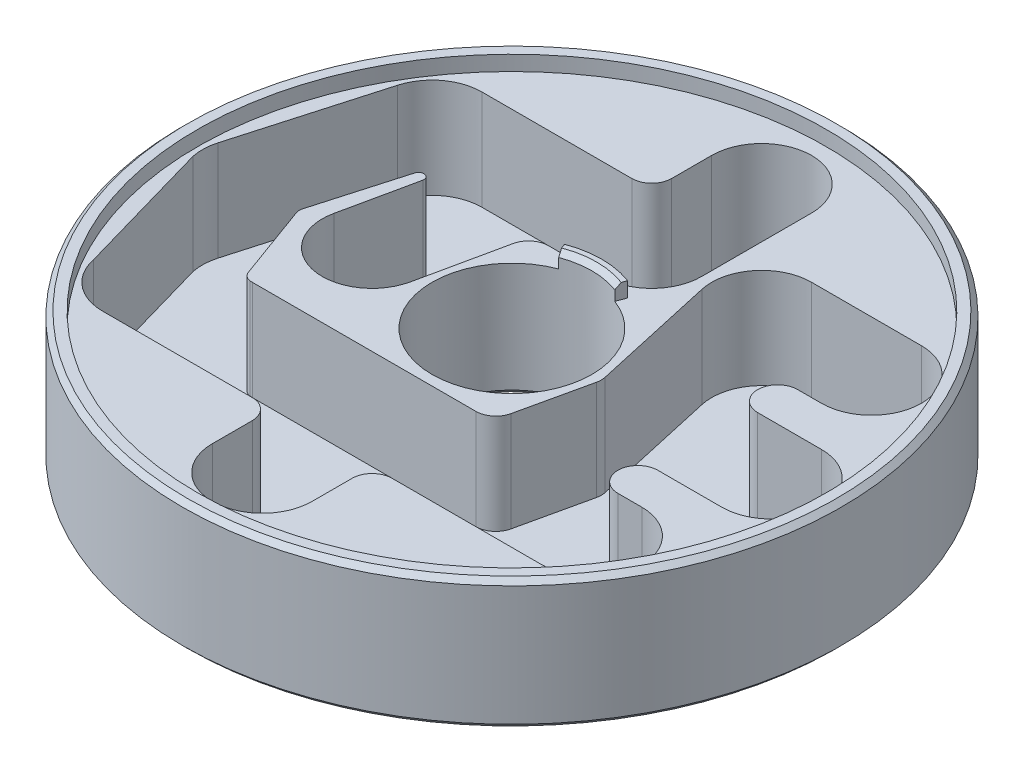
ISO-10303-21;
HEADER;
FILE_DESCRIPTION(('STEP AP214'),'2;1');
FILE_NAME('part.step','',(''),(''),'','','');
FILE_SCHEMA(('AUTOMOTIVE_DESIGN { 1 0 10303 214 1 1 1 1 }'));
ENDSEC;
DATA;
#1=APPLICATION_CONTEXT('core data for automotive mechanical design processes');
#2=APPLICATION_PROTOCOL_DEFINITION('international standard','automotive_design',2000,#1);
#3=PRODUCT_CONTEXT('',#1,'mechanical');
#4=PRODUCT('Part','Part','',(#3));
#5=PRODUCT_RELATED_PRODUCT_CATEGORY('part','',(#4));
#6=PRODUCT_DEFINITION_FORMATION('','',#4);
#7=PRODUCT_DEFINITION_CONTEXT('part definition',#1,'design');
#8=PRODUCT_DEFINITION('design','',#6,#7);
#9=PRODUCT_DEFINITION_SHAPE('','',#8);
#10=(LENGTH_UNIT() NAMED_UNIT(*) SI_UNIT(.MILLI.,.METRE.));
#11=(NAMED_UNIT(*) PLANE_ANGLE_UNIT() SI_UNIT($,.RADIAN.));
#12=(NAMED_UNIT(*) SI_UNIT($,.STERADIAN.) SOLID_ANGLE_UNIT());
#13=UNCERTAINTY_MEASURE_WITH_UNIT(LENGTH_MEASURE(1.E-05),#10,'distance_accuracy_value','');
#14=(GEOMETRIC_REPRESENTATION_CONTEXT(3) GLOBAL_UNCERTAINTY_ASSIGNED_CONTEXT((#13)) GLOBAL_UNIT_ASSIGNED_CONTEXT((#10,
#11,#12)) REPRESENTATION_CONTEXT('',''));
#15=CARTESIAN_POINT('',(0.,0.,0.));
#16=DIRECTION('',(0.,0.,1.));
#17=DIRECTION('',(1.,0.,0.));
#18=AXIS2_PLACEMENT_3D('',#15,#16,#17);
#19=CARTESIAN_POINT('',(0.,0.,0.));
#20=DIRECTION('',(0.,1.,0.));
#21=DIRECTION('',(0.,0.,1.));
#22=AXIS2_PLACEMENT_3D('',#19,#20,#21);
#23=PLANE('',#22);
#24=DIRECTION('',(0.351123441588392,0.,0.936329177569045));
#25=VECTOR('',#24,1.);
#26=CARTESIAN_POINT('',(-2.80898753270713,0.,-7.49063342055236));
#27=LINE('',#26,#25);
#28=CARTESIAN_POINT('',(-3.16011097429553,0.,-8.4269625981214));
#29=VERTEX_POINT('',#28);
#30=CARTESIAN_POINT('',(-2.98454925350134,0.,-7.95879800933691));
#31=VERTEX_POINT('',#30);
#32=EDGE_CURVE('E608',#29,#31,#27,.T.);
#33=ORIENTED_EDGE('',*,*,#32,.T.);
#34=CARTESIAN_POINT('',(0.,0.,0.));
#35=DIRECTION('',(0.,1.,0.));
#36=DIRECTION('',(0.,0.,1.));
#37=AXIS2_PLACEMENT_3D('',#34,#35,#36);
#38=CIRCLE('',#37,8.50000000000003);
#39=CARTESIAN_POINT('',(2.98454925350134,0.,-7.95879800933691));
#40=VERTEX_POINT('',#39);
#41=EDGE_CURVE('E636',#31,#40,#38,.F.);
#42=ORIENTED_EDGE('',*,*,#41,.T.);
#43=DIRECTION('',(0.351123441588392,0.,-0.936329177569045));
#44=VECTOR('',#43,1.);
#45=CARTESIAN_POINT('',(2.80898753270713,0.,-7.49063342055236));
#46=LINE('',#45,#44);
#47=CARTESIAN_POINT('',(3.16011097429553,0.,-8.4269625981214));
#48=VERTEX_POINT('',#47);
#49=EDGE_CURVE('E596',#40,#48,#46,.T.);
#50=ORIENTED_EDGE('',*,*,#49,.T.);
#51=CARTESIAN_POINT('',(0.,0.,0.));
#52=DIRECTION('',(0.,1.,0.));
#53=DIRECTION('',(0.,0.,1.));
#54=AXIS2_PLACEMENT_3D('',#51,#52,#53);
#55=CIRCLE('',#54,9.);
#56=EDGE_CURVE('E548',#48,#29,#55,.T.);
#57=ORIENTED_EDGE('',*,*,#56,.T.);
#58=EDGE_LOOP('',(#33,#42,#50,#57));
#59=FACE_BOUND('',#58,.T.);
#60=ADVANCED_FACE('F33',(#59),#23,.T.);
#61=CARTESIAN_POINT('',(0.,-13.,0.));
#62=DIRECTION('',(0.,1.,0.));
#63=DIRECTION('',(0.,0.,1.));
#64=AXIS2_PLACEMENT_3D('',#61,#62,#63);
#65=CYLINDRICAL_SURFACE('',#64,8.);
#66=CARTESIAN_POINT('',(0.,-12.5,0.));
#67=DIRECTION('',(0.,1.,0.));
#68=DIRECTION('',(0.,0.,1.));
#69=AXIS2_PLACEMENT_3D('',#66,#67,#68);
#70=CIRCLE('',#69,8.);
#71=CARTESIAN_POINT('',(0.,-12.5,8.));
#72=VERTEX_POINT('',#71);
#73=EDGE_CURVE('E626',#72,#72,#70,.F.);
#74=ORIENTED_EDGE('',*,*,#73,.T.);
#75=EDGE_LOOP('',(#74));
#76=FACE_BOUND('',#75,.T.);
#77=DIRECTION('',(0.,1.,0.));
#78=VECTOR('',#77,1.);
#79=CARTESIAN_POINT('',(2.80898753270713,-1.5,-7.49063342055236));
#80=LINE('',#79,#78);
#81=CARTESIAN_POINT('',(2.80898753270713,-1.5,-7.49063342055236));
#82=VERTEX_POINT('',#81);
#83=CARTESIAN_POINT('',(2.80898753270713,-0.500000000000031,-7.49063342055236));
#84=VERTEX_POINT('',#83);
#85=EDGE_CURVE('E612',#82,#84,#80,.T.);
#86=ORIENTED_EDGE('',*,*,#85,.T.);
#87=CARTESIAN_POINT('',(0.,-0.500000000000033,0.));
#88=DIRECTION('',(0.,1.,0.));
#89=DIRECTION('',(0.,0.,1.));
#90=AXIS2_PLACEMENT_3D('',#87,#88,#89);
#91=CIRCLE('',#90,8.);
#92=CARTESIAN_POINT('',(-2.80898753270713,-0.500000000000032,-7.49063342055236));
#93=VERTEX_POINT('',#92);
#94=EDGE_CURVE('E631',#84,#93,#91,.T.);
#95=ORIENTED_EDGE('',*,*,#94,.T.);
#96=DIRECTION('',(0.,1.,0.));
#97=VECTOR('',#96,1.);
#98=CARTESIAN_POINT('',(-2.80898753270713,-1.5,-7.49063342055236));
#99=LINE('',#98,#97);
#100=CARTESIAN_POINT('',(-2.80898753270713,-1.5,-7.49063342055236));
#101=VERTEX_POINT('',#100);
#102=EDGE_CURVE('E616',#101,#93,#99,.T.);
#103=ORIENTED_EDGE('',*,*,#102,.F.);
#104=CARTESIAN_POINT('',(0.,-1.5,0.));
#105=DIRECTION('',(0.,1.,0.));
#106=DIRECTION('',(0.,0.,1.));
#107=AXIS2_PLACEMENT_3D('',#104,#105,#106);
#108=CIRCLE('',#107,8.);
#109=EDGE_CURVE('E602',#101,#82,#108,.T.);
#110=ORIENTED_EDGE('',*,*,#109,.T.);
#111=EDGE_LOOP('',(#86,#95,#103,#110));
#112=FACE_BOUND('',#111,.T.);
#113=ADVANCED_FACE('F956',(#76,#112),#65,.F.);
#114=CARTESIAN_POINT('',(0.,-13.,0.));
#115=DIRECTION('',(0.,1.,0.));
#116=DIRECTION('',(0.,0.,1.));
#117=AXIS2_PLACEMENT_3D('',#114,#115,#116);
#118=CYLINDRICAL_SURFACE('',#117,33.);
#119=CARTESIAN_POINT('',(0.,-12.5,0.));
#120=DIRECTION('',(0.,1.,0.));
#121=DIRECTION('',(0.,0.,1.));
#122=AXIS2_PLACEMENT_3D('',#119,#120,#121);
#123=CIRCLE('',#122,33.);
#124=CARTESIAN_POINT('',(0.,-12.5,33.));
#125=VERTEX_POINT('',#124);
#126=EDGE_CURVE('E649',#125,#125,#123,.T.);
#127=CARTESIAN_POINT('',(0.,-0.499999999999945,0.));
#128=DIRECTION('',(0.,1.,0.));
#129=DIRECTION('',(0.,0.,1.));
#130=AXIS2_PLACEMENT_3D('',#127,#128,#129);
#131=CIRCLE('',#130,33.);
#132=CARTESIAN_POINT('',(0.,-0.499999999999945,33.));
#133=VERTEX_POINT('',#132);
#134=EDGE_CURVE('E646',#133,#133,#131,.F.);
#135=CARTESIAN_POINT('',(0.,-12.5,33.));
#136=CARTESIAN_POINT('',(0.,-12.375,33.));
#137=CARTESIAN_POINT('',(0.,-12.25,33.));
#138=CARTESIAN_POINT('',(0.,-12.,33.));
#139=CARTESIAN_POINT('',(0.,-11.875,33.));
#140=CARTESIAN_POINT('',(0.,-11.625,33.));
#141=CARTESIAN_POINT('',(0.,-11.5,33.));
#142=CARTESIAN_POINT('',(0.,-11.25,33.));
#143=CARTESIAN_POINT('',(0.,-11.125,33.));
#144=CARTESIAN_POINT('',(0.,-10.875,33.));
#145=CARTESIAN_POINT('',(0.,-10.75,33.));
#146=CARTESIAN_POINT('',(0.,-10.5,33.));
#147=CARTESIAN_POINT('',(0.,-10.375,33.));
#148=CARTESIAN_POINT('',(0.,-10.125,33.));
#149=CARTESIAN_POINT('',(0.,-9.99999999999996,33.));
#150=CARTESIAN_POINT('',(0.,-9.74999999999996,33.));
#151=CARTESIAN_POINT('',(0.,-9.62499999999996,33.));
#152=CARTESIAN_POINT('',(0.,-9.37499999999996,33.));
#153=CARTESIAN_POINT('',(0.,-9.24999999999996,33.));
#154=CARTESIAN_POINT('',(0.,-8.99999999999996,33.));
#155=CARTESIAN_POINT('',(0.,-8.87499999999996,33.));
#156=CARTESIAN_POINT('',(0.,-8.62499999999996,33.));
#157=CARTESIAN_POINT('',(0.,-8.49999999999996,33.));
#158=CARTESIAN_POINT('',(0.,-8.24999999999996,33.));
#159=CARTESIAN_POINT('',(0.,-8.12499999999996,33.));
#160=CARTESIAN_POINT('',(0.,-7.87499999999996,33.));
#161=CARTESIAN_POINT('',(0.,-7.74999999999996,33.));
#162=CARTESIAN_POINT('',(0.,-7.49999999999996,33.));
#163=CARTESIAN_POINT('',(0.,-7.37499999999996,33.));
#164=CARTESIAN_POINT('',(0.,-7.12499999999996,33.));
#165=CARTESIAN_POINT('',(0.,-6.99999999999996,33.));
#166=CARTESIAN_POINT('',(0.,-6.74999999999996,33.));
#167=CARTESIAN_POINT('',(0.,-6.62499999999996,33.));
#168=CARTESIAN_POINT('',(0.,-6.37499999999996,33.));
#169=CARTESIAN_POINT('',(0.,-6.24999999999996,33.));
#170=CARTESIAN_POINT('',(0.,-5.99999999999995,33.));
#171=CARTESIAN_POINT('',(0.,-5.87499999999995,33.));
#172=CARTESIAN_POINT('',(0.,-5.62499999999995,33.));
#173=CARTESIAN_POINT('',(0.,-5.49999999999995,33.));
#174=CARTESIAN_POINT('',(0.,-5.24999999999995,33.));
#175=CARTESIAN_POINT('',(0.,-5.12499999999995,33.));
#176=CARTESIAN_POINT('',(0.,-4.87499999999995,33.));
#177=CARTESIAN_POINT('',(0.,-4.74999999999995,33.));
#178=CARTESIAN_POINT('',(0.,-4.49999999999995,33.));
#179=CARTESIAN_POINT('',(0.,-4.37499999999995,33.));
#180=CARTESIAN_POINT('',(0.,-4.12499999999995,33.));
#181=CARTESIAN_POINT('',(0.,-3.99999999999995,33.));
#182=CARTESIAN_POINT('',(0.,-3.74999999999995,33.));
#183=CARTESIAN_POINT('',(0.,-3.62499999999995,33.));
#184=CARTESIAN_POINT('',(0.,-3.37499999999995,33.));
#185=CARTESIAN_POINT('',(0.,-3.24999999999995,33.));
#186=CARTESIAN_POINT('',(0.,-2.99999999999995,33.));
#187=CARTESIAN_POINT('',(0.,-2.87499999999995,33.));
#188=CARTESIAN_POINT('',(0.,-2.62499999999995,33.));
#189=CARTESIAN_POINT('',(0.,-2.49999999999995,33.));
#190=CARTESIAN_POINT('',(0.,-2.24999999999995,33.));
#191=CARTESIAN_POINT('',(0.,-2.12499999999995,33.));
#192=CARTESIAN_POINT('',(0.,-1.87499999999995,33.));
#193=CARTESIAN_POINT('',(0.,-1.74999999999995,33.));
#194=CARTESIAN_POINT('',(0.,-1.49999999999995,33.));
#195=CARTESIAN_POINT('',(0.,-1.37499999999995,33.));
#196=CARTESIAN_POINT('',(0.,-1.12499999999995,33.));
#197=CARTESIAN_POINT('',(0.,-0.999999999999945,33.));
#198=CARTESIAN_POINT('',(0.,-0.749999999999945,33.));
#199=CARTESIAN_POINT('',(0.,-0.624999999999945,33.));
#200=CARTESIAN_POINT('',(0.,-0.499999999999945,33.));
#201=B_SPLINE_CURVE_WITH_KNOTS('',3,(#135,#136,#137,#138,#139,#140,#141,#142,#143,#144,#145,
#146,#147,#148,#149,#150,#151,#152,#153,#154,#155,#156,#157,#158,#159,#160,#161,#162,#163,#164,
#165,#166,#167,#168,#169,#170,#171,#172,#173,#174,#175,#176,#177,#178,#179,#180,#181,#182,#183,
#184,#185,#186,#187,#188,#189,#190,#191,#192,#193,#194,#195,#196,#197,#198,#199,#200),
.UNSPECIFIED.,.F.,.F.,(4,2,2,2,2,2,2,2,2,2,2,2,2,2,2,2,2,2,2,2,2,2,2,2,2,2,2,2,2,2,2,2,4),(0.,
0.375,0.750000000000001,1.125,1.5,1.875,2.25,2.625,3.,3.375,3.75,4.12500000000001,
4.50000000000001,4.87500000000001,5.25000000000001,5.62500000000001,6.00000000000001,
6.37500000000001,6.75000000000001,7.12500000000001,7.50000000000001,7.87500000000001,
8.25000000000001,8.62500000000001,9.00000000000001,9.37500000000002,9.75000000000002,10.125,
10.5,10.875,11.25,11.625,12.),.UNSPECIFIED.);
#202=EDGE_CURVE('BSEAM963',#125,#133,#201,.T.);
#203=ORIENTED_EDGE('',*,*,#126,.T.);
#204=ORIENTED_EDGE('',*,*,#134,.T.);
#205=ORIENTED_EDGE('',*,*,#202,.T.);
#206=ORIENTED_EDGE('',*,*,#202,.F.);
#207=EDGE_LOOP('',(#203,#205,#204,#206));
#208=FACE_BOUND('',#207,.T.);
#209=ADVANCED_FACE('F963',(#208),#118,.T.);
#210=CARTESIAN_POINT('',(0.,-13.,0.));
#211=DIRECTION('',(0.,1.,0.));
#212=DIRECTION('',(0.,0.,1.));
#213=AXIS2_PLACEMENT_3D('',#210,#211,#212);
#214=PLANE('',#213);
#215=CARTESIAN_POINT('',(-14.,-13.,0.));
#216=DIRECTION('',(0.,1.,0.));
#217=DIRECTION('',(0.,0.,1.));
#218=AXIS2_PLACEMENT_3D('',#215,#216,#217);
#219=CIRCLE('',#218,5.);
#220=CARTESIAN_POINT('',(-14.,-13.,5.));
#221=VERTEX_POINT('',#220);
#222=EDGE_CURVE('E384',#221,#221,#219,.T.);
#223=ORIENTED_EDGE('',*,*,#222,.T.);
#224=EDGE_LOOP('',(#223));
#225=FACE_BOUND('',#224,.T.);
#226=CARTESIAN_POINT('',(26.,-13.,0.));
#227=DIRECTION('',(0.,1.,0.));
#228=DIRECTION('',(0.,0.,1.));
#229=AXIS2_PLACEMENT_3D('',#226,#227,#228);
#230=CIRCLE('',#229,5.);
#231=CARTESIAN_POINT('',(26.,-13.,5.));
#232=VERTEX_POINT('',#231);
#233=EDGE_CURVE('E459',#232,#232,#230,.T.);
#234=ORIENTED_EDGE('',*,*,#233,.T.);
#235=EDGE_LOOP('',(#234));
#236=FACE_BOUND('',#235,.T.);
#237=CARTESIAN_POINT('',(0.,-13.,0.));
#238=DIRECTION('',(0.,1.,0.));
#239=DIRECTION('',(0.,0.,1.));
#240=AXIS2_PLACEMENT_3D('',#237,#238,#239);
#241=CIRCLE('',#240,8.49999999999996);
#242=CARTESIAN_POINT('',(0.,-13.,8.49999999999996));
#243=VERTEX_POINT('',#242);
#244=EDGE_CURVE('E643',#243,#243,#241,.T.);
#245=ORIENTED_EDGE('',*,*,#244,.T.);
#246=EDGE_LOOP('',(#245));
#247=FACE_BOUND('',#246,.T.);
#248=CARTESIAN_POINT('',(0.,-13.,0.));
#249=DIRECTION('',(0.,1.,0.));
#250=DIRECTION('',(0.,0.,1.));
#251=AXIS2_PLACEMENT_3D('',#248,#249,#250);
#252=CIRCLE('',#251,32.5);
#253=CARTESIAN_POINT('',(0.,-13.,32.5));
#254=VERTEX_POINT('',#253);
#255=EDGE_CURVE('E640',#254,#254,#252,.F.);
#256=ORIENTED_EDGE('',*,*,#255,.T.);
#257=EDGE_LOOP('',(#256));
#258=FACE_BOUND('',#257,.T.);
#259=ADVANCED_FACE('F970',(#225,#236,#247,#258),#214,.F.);
#260=CARTESIAN_POINT('',(0.,0.,0.));
#261=DIRECTION('',(0.,1.,0.));
#262=DIRECTION('',(0.,0.,1.));
#263=AXIS2_PLACEMENT_3D('',#260,#261,#262);
#264=CIRCLE('',#263,32.5);
#265=CARTESIAN_POINT('',(0.,0.,32.5));
#266=VERTEX_POINT('',#265);
#267=EDGE_CURVE('E652',#266,#266,#264,.T.);
#268=ORIENTED_EDGE('',*,*,#267,.T.);
#269=EDGE_LOOP('',(#268));
#270=FACE_BOUND('',#269,.T.);
#271=CARTESIAN_POINT('',(0.,0.,0.));
#272=DIRECTION('',(0.,1.,0.));
#273=DIRECTION('',(0.,0.,1.));
#274=AXIS2_PLACEMENT_3D('',#271,#272,#273);
#275=CIRCLE('',#274,31.5);
#276=CARTESIAN_POINT('',(0.,0.,31.5));
#277=VERTEX_POINT('',#276);
#278=EDGE_CURVE('E615',#277,#277,#275,.T.);
#279=ORIENTED_EDGE('',*,*,#278,.F.);
#280=EDGE_LOOP('',(#279));
#281=FACE_BOUND('',#280,.T.);
#282=ADVANCED_FACE('F959',(#270,#281),#23,.T.);
#283=CARTESIAN_POINT('',(0.,-1.5,0.));
#284=DIRECTION('',(0.,1.,0.));
#285=DIRECTION('',(0.,0.,1.));
#286=AXIS2_PLACEMENT_3D('',#283,#284,#285);
#287=CYLINDRICAL_SURFACE('',#286,31.5);
#288=CARTESIAN_POINT('',(0.,-1.5,0.));
#289=DIRECTION('',(0.,1.,0.));
#290=DIRECTION('',(0.,0.,1.));
#291=AXIS2_PLACEMENT_3D('',#288,#289,#290);
#292=CIRCLE('',#291,31.5);
#293=CARTESIAN_POINT('',(0.,-1.5,31.5));
#294=VERTEX_POINT('',#293);
#295=EDGE_CURVE('E623',#294,#294,#292,.T.);
#296=ORIENTED_EDGE('',*,*,#295,.F.);
#297=EDGE_LOOP('',(#296));
#298=FACE_BOUND('',#297,.T.);
#299=ORIENTED_EDGE('',*,*,#278,.T.);
#300=EDGE_LOOP('',(#299));
#301=FACE_BOUND('',#300,.T.);
#302=ADVANCED_FACE('F969',(#298,#301),#287,.F.);
#303=CARTESIAN_POINT('',(0.,-1.5,0.));
#304=DIRECTION('',(0.,1.,0.));
#305=DIRECTION('',(0.,0.,1.));
#306=AXIS2_PLACEMENT_3D('',#303,#304,#305);
#307=PLANE('',#306);
#308=DIRECTION('',(-0.343053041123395,0.,-0.939316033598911));
#309=VECTOR('',#308,1.);
#310=CARTESIAN_POINT('',(-20.9387591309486,-1.5,0.446684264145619));
#311=LINE('',#310,#309);
#312=CARTESIAN_POINT('',(-18.0583484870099,-1.5,8.33355765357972));
#313=VERTEX_POINT('',#312);
#314=CARTESIAN_POINT('',(-20.8271162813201,-1.5,0.75237436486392));
#315=VERTEX_POINT('',#314);
#316=EDGE_CURVE('E787',#313,#315,#311,.T.);
#317=ORIENTED_EDGE('',*,*,#316,.F.);
#318=CARTESIAN_POINT('',(-17.119032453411,-1.5,7.99050461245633));
#319=DIRECTION('',(0.,1.,0.));
#320=DIRECTION('',(0.,0.,1.));
#321=AXIS2_PLACEMENT_3D('',#318,#319,#320);
#322=CIRCLE('',#321,1.);
#323=CARTESIAN_POINT('',(-17.25651195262,-1.5,8.98100922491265));
#324=VERTEX_POINT('',#323);
#325=EDGE_CURVE('E55',#313,#324,#322,.T.);
#326=ORIENTED_EDGE('',*,*,#325,.T.);
#327=CARTESIAN_POINT('',(-16.9815529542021,-1.5,7.));
#328=DIRECTION('',(0.,1.,0.));
#329=DIRECTION('',(0.,0.,1.));
#330=AXIS2_PLACEMENT_3D('',#327,#328,#329);
#331=CIRCLE('',#330,2.);
#332=CARTESIAN_POINT('',(-16.9815529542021,-1.5,9.));
#333=VERTEX_POINT('',#332);
#334=EDGE_CURVE('E665',#324,#333,#331,.T.);
#335=ORIENTED_EDGE('',*,*,#334,.T.);
#336=DIRECTION('',(1.,0.,0.));
#337=VECTOR('',#336,1.);
#338=CARTESIAN_POINT('',(0.,-1.5,9.));
#339=LINE('',#338,#337);
#340=CARTESIAN_POINT('',(5.38940547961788,-1.5,9.));
#341=VERTEX_POINT('',#340);
#342=EDGE_CURVE('E480',#333,#341,#339,.T.);
#343=ORIENTED_EDGE('',*,*,#342,.T.);
#344=CARTESIAN_POINT('',(5.38940547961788,-1.5,7.));
#345=DIRECTION('',(0.,1.,0.));
#346=DIRECTION('',(0.,0.,1.));
#347=AXIS2_PLACEMENT_3D('',#344,#345,#346);
#348=CIRCLE('',#347,2.);
#349=CARTESIAN_POINT('',(7.3414313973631,-1.5,7.43542486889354));
#350=VERTEX_POINT('',#349);
#351=EDGE_CURVE('E661',#341,#350,#348,.T.);
#352=ORIENTED_EDGE('',*,*,#351,.T.);
#353=DIRECTION('',(-0.217712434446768,0.,0.976012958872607));
#354=VECTOR('',#353,1.);
#355=CARTESIAN_POINT('',(8.57341166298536,-1.5,1.91241141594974));
#356=LINE('',#355,#354);
#357=CARTESIAN_POINT('',(8.90287279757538,-1.5,0.435424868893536));
#358=VERTEX_POINT('',#357);
#359=EDGE_CURVE('E477',#358,#350,#356,.T.);
#360=ORIENTED_EDGE('',*,*,#359,.F.);
#361=CARTESIAN_POINT('',(6.95084687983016,-1.5,0.));
#362=DIRECTION('',(0.,1.,0.));
#363=DIRECTION('',(0.,0.,1.));
#364=AXIS2_PLACEMENT_3D('',#361,#362,#363);
#365=CIRCLE('',#364,2.);
#366=CARTESIAN_POINT('',(8.90287279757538,-1.5,-0.435424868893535));
#367=VERTEX_POINT('',#366);
#368=EDGE_CURVE('E663',#358,#367,#365,.T.);
#369=ORIENTED_EDGE('',*,*,#368,.T.);
#370=DIRECTION('',(-0.217712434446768,0.,-0.976012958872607));
#371=VECTOR('',#370,1.);
#372=CARTESIAN_POINT('',(8.57341166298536,-1.5,-1.91241141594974));
#373=LINE('',#372,#371);
#374=CARTESIAN_POINT('',(6.119935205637,-1.5,-12.9114378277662));
#375=VERTEX_POINT('',#374);
#376=EDGE_CURVE('E475',#367,#375,#373,.T.);
#377=ORIENTED_EDGE('',*,*,#376,.T.);
#378=CARTESIAN_POINT('',(11.,-1.5,-14.));
#379=DIRECTION('',(0.,1.,0.));
#380=DIRECTION('',(0.,0.,1.));
#381=AXIS2_PLACEMENT_3D('',#378,#379,#380);
#382=CIRCLE('',#381,4.99999999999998);
#383=CARTESIAN_POINT('',(11.,-1.5,-19.));
#384=VERTEX_POINT('',#383);
#385=EDGE_CURVE('E472',#384,#375,#382,.T.);
#386=ORIENTED_EDGE('',*,*,#385,.F.);
#387=DIRECTION('',(1.,0.,0.));
#388=VECTOR('',#387,1.);
#389=CARTESIAN_POINT('',(0.,-1.5,-19.));
#390=LINE('',#389,#388);
#391=CARTESIAN_POINT('',(22.,-1.5,-19.));
#392=VERTEX_POINT('',#391);
#393=EDGE_CURVE('E469',#384,#392,#390,.T.);
#394=ORIENTED_EDGE('',*,*,#393,.T.);
#395=CARTESIAN_POINT('',(22.,-1.5,-14.));
#396=DIRECTION('',(0.,1.,0.));
#397=DIRECTION('',(0.,0.,1.));
#398=AXIS2_PLACEMENT_3D('',#395,#396,#397);
#399=CIRCLE('',#398,5.);
#400=CARTESIAN_POINT('',(22.,-1.5,-9.));
#401=VERTEX_POINT('',#400);
#402=EDGE_CURVE('E466',#401,#392,#399,.T.);
#403=ORIENTED_EDGE('',*,*,#402,.F.);
#404=DIRECTION('',(1.,0.,0.));
#405=VECTOR('',#404,1.);
#406=CARTESIAN_POINT('',(0.,-1.5,-9.));
#407=LINE('',#406,#405);
#408=CARTESIAN_POINT('',(19.6105945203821,-1.5,-9.));
#409=VERTEX_POINT('',#408);
#410=EDGE_CURVE('E464',#409,#401,#407,.T.);
#411=ORIENTED_EDGE('',*,*,#410,.F.);
#412=CARTESIAN_POINT('',(19.6105945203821,-1.5,-7.));
#413=DIRECTION('',(0.,1.,0.));
#414=DIRECTION('',(0.,0.,1.));
#415=AXIS2_PLACEMENT_3D('',#412,#413,#414);
#416=CIRCLE('',#415,2.);
#417=CARTESIAN_POINT('',(17.6585686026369,-1.5,-6.56457513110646));
#418=VERTEX_POINT('',#417);
#419=EDGE_CURVE('E696',#409,#418,#416,.T.);
#420=ORIENTED_EDGE('',*,*,#419,.T.);
#421=CARTESIAN_POINT('',(19.6105945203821,-1.5,-7.));
#422=DIRECTION('',(0.,1.,0.));
#423=DIRECTION('',(0.,0.,1.));
#424=AXIS2_PLACEMENT_3D('',#421,#422,#423);
#425=CIRCLE('',#424,2.);
#426=CARTESIAN_POINT('',(19.6105945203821,-1.5,-5.));
#427=VERTEX_POINT('',#426);
#428=EDGE_CURVE('E694',#418,#427,#425,.T.);
#429=ORIENTED_EDGE('',*,*,#428,.T.);
#430=DIRECTION('',(1.,0.,0.));
#431=VECTOR('',#430,1.);
#432=CARTESIAN_POINT('',(0.,-1.5,-4.99999999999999));
#433=LINE('',#432,#431);
#434=CARTESIAN_POINT('',(26.,-1.5,-5.));
#435=VERTEX_POINT('',#434);
#436=EDGE_CURVE('E462',#427,#435,#433,.T.);
#437=ORIENTED_EDGE('',*,*,#436,.T.);
#438=CARTESIAN_POINT('',(26.,-1.5,0.));
#439=DIRECTION('',(0.,1.,0.));
#440=DIRECTION('',(0.,0.,1.));
#441=AXIS2_PLACEMENT_3D('',#438,#439,#440);
#442=CIRCLE('',#441,5.);
#443=CARTESIAN_POINT('',(26.,-1.5,5.));
#444=VERTEX_POINT('',#443);
#445=EDGE_CURVE('E458',#444,#435,#442,.T.);
#446=ORIENTED_EDGE('',*,*,#445,.F.);
#447=DIRECTION('',(1.,0.,0.));
#448=VECTOR('',#447,1.);
#449=CARTESIAN_POINT('',(0.,-1.5,5.));
#450=LINE('',#449,#448);
#451=CARTESIAN_POINT('',(19.6105945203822,-1.5,5.));
#452=VERTEX_POINT('',#451);
#453=EDGE_CURVE('E456',#452,#444,#450,.T.);
#454=ORIENTED_EDGE('',*,*,#453,.F.);
#455=CARTESIAN_POINT('',(19.6105945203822,-1.5,7.));
#456=DIRECTION('',(0.,1.,0.));
#457=DIRECTION('',(0.,0.,1.));
#458=AXIS2_PLACEMENT_3D('',#455,#456,#457);
#459=CIRCLE('',#458,2.);
#460=CARTESIAN_POINT('',(17.658568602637,-1.5,6.56457513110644));
#461=VERTEX_POINT('',#460);
#462=EDGE_CURVE('E698',#452,#461,#459,.T.);
#463=ORIENTED_EDGE('',*,*,#462,.T.);
#464=CARTESIAN_POINT('',(19.6105945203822,-1.5,7.));
#465=DIRECTION('',(0.,1.,0.));
#466=DIRECTION('',(0.,0.,1.));
#467=AXIS2_PLACEMENT_3D('',#464,#465,#466);
#468=CIRCLE('',#467,2.);
#469=CARTESIAN_POINT('',(19.6105945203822,-1.5,9.));
#470=VERTEX_POINT('',#469);
#471=EDGE_CURVE('E700',#461,#470,#468,.T.);
#472=ORIENTED_EDGE('',*,*,#471,.T.);
#473=DIRECTION('',(1.,0.,0.));
#474=VECTOR('',#473,1.);
#475=CARTESIAN_POINT('',(0.,-1.5,9.00000000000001));
#476=LINE('',#475,#474);
#477=CARTESIAN_POINT('',(22.,-1.5,9.));
#478=VERTEX_POINT('',#477);
#479=EDGE_CURVE('E542',#470,#478,#476,.T.);
#480=ORIENTED_EDGE('',*,*,#479,.T.);
#481=CARTESIAN_POINT('',(22.,-1.5,14.));
#482=DIRECTION('',(0.,1.,0.));
#483=DIRECTION('',(0.,0.,1.));
#484=AXIS2_PLACEMENT_3D('',#481,#482,#483);
#485=CIRCLE('',#484,5.);
#486=CARTESIAN_POINT('',(22.,-1.5,19.));
#487=VERTEX_POINT('',#486);
#488=EDGE_CURVE('E539',#478,#487,#485,.F.);
#489=ORIENTED_EDGE('',*,*,#488,.T.);
#490=DIRECTION('',(1.,0.,0.));
#491=VECTOR('',#490,1.);
#492=CARTESIAN_POINT('',(0.,-1.5,19.));
#493=LINE('',#492,#491);
#494=CARTESIAN_POINT('',(6.99999999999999,-1.5,19.));
#495=VERTEX_POINT('',#494);
#496=EDGE_CURVE('E537',#495,#487,#493,.T.);
#497=ORIENTED_EDGE('',*,*,#496,.F.);
#498=CARTESIAN_POINT('',(6.99999999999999,-1.5,21.));
#499=DIRECTION('',(0.,1.,0.));
#500=DIRECTION('',(0.,0.,1.));
#501=AXIS2_PLACEMENT_3D('',#498,#499,#500);
#502=CIRCLE('',#501,2.);
#503=CARTESIAN_POINT('',(4.99999999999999,-1.5,21.));
#504=VERTEX_POINT('',#503);
#505=EDGE_CURVE('E704',#495,#504,#502,.T.);
#506=ORIENTED_EDGE('',*,*,#505,.T.);
#507=DIRECTION('',(0.,0.,-1.));
#508=VECTOR('',#507,1.);
#509=CARTESIAN_POINT('',(5.00000000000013,-1.5,0.));
#510=LINE('',#509,#508);
#511=CARTESIAN_POINT('',(4.99999999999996,-1.5,25.));
#512=VERTEX_POINT('',#511);
#513=EDGE_CURVE('E534',#512,#504,#510,.T.);
#514=ORIENTED_EDGE('',*,*,#513,.F.);
#515=CARTESIAN_POINT('',(0.,-1.5,25.));
#516=DIRECTION('',(0.,1.,0.));
#517=DIRECTION('',(0.,0.,1.));
#518=AXIS2_PLACEMENT_3D('',#515,#516,#517);
#519=CIRCLE('',#518,5.);
#520=CARTESIAN_POINT('',(-5.00000000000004,-1.5,25.));
#521=VERTEX_POINT('',#520);
#522=EDGE_CURVE('E531',#512,#521,#519,.F.);
#523=ORIENTED_EDGE('',*,*,#522,.T.);
#524=DIRECTION('',(0.,0.,-1.));
#525=VECTOR('',#524,1.);
#526=CARTESIAN_POINT('',(-4.99999999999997,-1.5,0.));
#527=LINE('',#526,#525);
#528=CARTESIAN_POINT('',(-5.00000000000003,-1.5,21.));
#529=VERTEX_POINT('',#528);
#530=EDGE_CURVE('E528',#521,#529,#527,.T.);
#531=ORIENTED_EDGE('',*,*,#530,.T.);
#532=CARTESIAN_POINT('',(-7.00000000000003,-1.5,21.));
#533=DIRECTION('',(0.,1.,0.));
#534=DIRECTION('',(0.,0.,1.));
#535=AXIS2_PLACEMENT_3D('',#532,#533,#534);
#536=CIRCLE('',#535,2.);
#537=CARTESIAN_POINT('',(-7.00000000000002,-1.5,19.));
#538=VERTEX_POINT('',#537);
#539=EDGE_CURVE('E702',#529,#538,#536,.T.);
#540=ORIENTED_EDGE('',*,*,#539,.T.);
#541=DIRECTION('',(1.,0.,0.));
#542=VECTOR('',#541,1.);
#543=CARTESIAN_POINT('',(0.,-1.5,19.));
#544=LINE('',#543,#542);
#545=CARTESIAN_POINT('',(-22.,-1.5,18.9999999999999));
#546=VERTEX_POINT('',#545);
#547=EDGE_CURVE('E525',#546,#538,#544,.T.);
#548=ORIENTED_EDGE('',*,*,#547,.F.);
#549=CARTESIAN_POINT('',(-22.,-1.5,13.9999999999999));
#550=DIRECTION('',(0.,1.,0.));
#551=DIRECTION('',(0.,0.,1.));
#552=AXIS2_PLACEMENT_3D('',#549,#550,#551);
#553=CIRCLE('',#552,4.99999999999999);
#554=CARTESIAN_POINT('',(-26.8992970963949,-1.5,14.9984427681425));
#555=VERTEX_POINT('',#554);
#556=EDGE_CURVE('E522',#555,#546,#553,.T.);
#557=ORIENTED_EDGE('',*,*,#556,.F.);
#558=DIRECTION('',(0.274962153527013,0.,0.961455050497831));
#559=VECTOR('',#558,1.);
#560=CARTESIAN_POINT('',(-28.8306422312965,-1.5,8.24514413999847));
#561=LINE('',#560,#559);
#562=CARTESIAN_POINT('',(-30.889022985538,-1.5,1.04764242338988));
#563=VERTEX_POINT('',#562);
#564=EDGE_CURVE('E519',#563,#555,#561,.T.);
#565=ORIENTED_EDGE('',*,*,#564,.F.);
#566=CARTESIAN_POINT('',(-26.,-1.5,0.));
#567=DIRECTION('',(0.,1.,0.));
#568=DIRECTION('',(0.,0.,1.));
#569=AXIS2_PLACEMENT_3D('',#566,#567,#568);
#570=CIRCLE('',#569,5.00001004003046);
#571=CARTESIAN_POINT('',(-30.8076284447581,-1.5,-1.37361171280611));
#572=VERTEX_POINT('',#571);
#573=EDGE_CURVE('E516',#572,#563,#570,.T.);
#574=ORIENTED_EDGE('',*,*,#573,.F.);
#575=DIRECTION('',(-0.274721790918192,0.,0.961523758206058));
#576=VECTOR('',#575,1.);
#577=CARTESIAN_POINT('',(-28.8453548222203,-1.5,-8.24155146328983));
#578=LINE('',#577,#576);
#579=CARTESIAN_POINT('',(-26.8076187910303,-1.5,-15.373608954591));
#580=VERTEX_POINT('',#579);
#581=EDGE_CURVE('E513',#580,#572,#578,.T.);
#582=ORIENTED_EDGE('',*,*,#581,.F.);
#583=CARTESIAN_POINT('',(-22.,-1.5,-13.9999999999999));
#584=DIRECTION('',(0.,1.,0.));
#585=DIRECTION('',(0.,0.,1.));
#586=AXIS2_PLACEMENT_3D('',#583,#584,#585);
#587=CIRCLE('',#586,4.99999999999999);
#588=CARTESIAN_POINT('',(-22.,-1.5,-18.9999999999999));
#589=VERTEX_POINT('',#588);
#590=EDGE_CURVE('E510',#580,#589,#587,.F.);
#591=ORIENTED_EDGE('',*,*,#590,.T.);
#592=DIRECTION('',(1.,0.,0.));
#593=VECTOR('',#592,1.);
#594=CARTESIAN_POINT('',(0.,-1.5,-19.));
#595=LINE('',#594,#593);
#596=CARTESIAN_POINT('',(-7.00000000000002,-1.5,-19.));
#597=VERTEX_POINT('',#596);
#598=EDGE_CURVE('E507',#589,#597,#595,.T.);
#599=ORIENTED_EDGE('',*,*,#598,.T.);
#600=CARTESIAN_POINT('',(-7.00000000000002,-1.5,-21.));
#601=DIRECTION('',(0.,1.,0.));
#602=DIRECTION('',(0.,0.,1.));
#603=AXIS2_PLACEMENT_3D('',#600,#601,#602);
#604=CIRCLE('',#603,2.);
#605=CARTESIAN_POINT('',(-5.00000000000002,-1.5,-21.));
#606=VERTEX_POINT('',#605);
#607=EDGE_CURVE('E667',#597,#606,#604,.T.);
#608=ORIENTED_EDGE('',*,*,#607,.T.);
#609=DIRECTION('',(0.,0.,1.));
#610=VECTOR('',#609,1.);
#611=CARTESIAN_POINT('',(-4.99999999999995,-1.5,0.));
#612=LINE('',#611,#610);
#613=CARTESIAN_POINT('',(-5.00000000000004,-1.5,-25.));
#614=VERTEX_POINT('',#613);
#615=EDGE_CURVE('E504',#614,#606,#612,.T.);
#616=ORIENTED_EDGE('',*,*,#615,.F.);
#617=CARTESIAN_POINT('',(0.,-1.5,-25.));
#618=DIRECTION('',(0.,1.,0.));
#619=DIRECTION('',(0.,0.,1.));
#620=AXIS2_PLACEMENT_3D('',#617,#618,#619);
#621=CIRCLE('',#620,5.);
#622=CARTESIAN_POINT('',(4.99999999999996,-1.5,-25.));
#623=VERTEX_POINT('',#622);
#624=EDGE_CURVE('E501',#623,#614,#621,.T.);
#625=ORIENTED_EDGE('',*,*,#624,.F.);
#626=DIRECTION('',(0.,0.,1.));
#627=VECTOR('',#626,1.);
#628=CARTESIAN_POINT('',(5.00000000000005,-1.5,0.));
#629=LINE('',#628,#627);
#630=CARTESIAN_POINT('',(5.,-1.5,-14.));
#631=VERTEX_POINT('',#630);
#632=EDGE_CURVE('E498',#623,#631,#629,.T.);
#633=ORIENTED_EDGE('',*,*,#632,.T.);
#634=CARTESIAN_POINT('',(0.,-1.5,-14.));
#635=DIRECTION('',(0.,1.,0.));
#636=DIRECTION('',(0.,0.,1.));
#637=AXIS2_PLACEMENT_3D('',#634,#635,#636);
#638=CIRCLE('',#637,5.);
#639=CARTESIAN_POINT('',(0.,-1.5,-9.));
#640=VERTEX_POINT('',#639);
#641=EDGE_CURVE('E495',#640,#631,#638,.T.);
#642=ORIENTED_EDGE('',*,*,#641,.F.);
#643=CARTESIAN_POINT('',(0.,-1.5,0.));
#644=DIRECTION('',(0.,1.,0.));
#645=DIRECTION('',(0.,0.,1.));
#646=AXIS2_PLACEMENT_3D('',#643,#644,#645);
#647=CIRCLE('',#646,9.);
#648=CARTESIAN_POINT('',(3.16011097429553,-1.5,-8.4269625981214));
#649=VERTEX_POINT('',#648);
#650=EDGE_CURVE('E597',#649,#640,#647,.T.);
#651=ORIENTED_EDGE('',*,*,#650,.F.);
#652=DIRECTION('',(0.351123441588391,0.,-0.936329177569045));
#653=VECTOR('',#652,1.);
#654=CARTESIAN_POINT('',(3.,-1.5,-8.));
#655=LINE('',#654,#653);
#656=EDGE_CURVE('E592',#82,#649,#655,.T.);
#657=ORIENTED_EDGE('',*,*,#656,.F.);
#658=ORIENTED_EDGE('',*,*,#109,.F.);
#659=DIRECTION('',(0.351123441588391,0.,0.936329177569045));
#660=VECTOR('',#659,1.);
#661=CARTESIAN_POINT('',(-3.,-1.5,-8.));
#662=LINE('',#661,#660);
#663=CARTESIAN_POINT('',(-3.16011097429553,-1.5,-8.4269625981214));
#664=VERTEX_POINT('',#663);
#665=EDGE_CURVE('E600',#664,#101,#662,.T.);
#666=ORIENTED_EDGE('',*,*,#665,.F.);
#667=EDGE_CURVE('E595',#640,#664,#647,.T.);
#668=ORIENTED_EDGE('',*,*,#667,.F.);
#669=DIRECTION('',(1.,0.,0.));
#670=VECTOR('',#669,1.);
#671=CARTESIAN_POINT('',(0.,-1.5,-9.));
#672=LINE('',#671,#670);
#673=CARTESIAN_POINT('',(-5.34108946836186,-1.5,-8.99999999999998));
#674=VERTEX_POINT('',#673);
#675=EDGE_CURVE('E493',#674,#640,#672,.T.);
#676=ORIENTED_EDGE('',*,*,#675,.F.);
#677=CARTESIAN_POINT('',(-5.34108946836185,-1.5,-6.99999999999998));
#678=DIRECTION('',(0.,1.,0.));
#679=DIRECTION('',(0.,0.,1.));
#680=AXIS2_PLACEMENT_3D('',#677,#678,#679);
#681=CIRCLE('',#680,2.);
#682=CARTESIAN_POINT('',(-7.29669429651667,-1.5,-7.41905817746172));
#683=VERTEX_POINT('',#682);
#684=EDGE_CURVE('E764',#674,#683,#681,.T.);
#685=ORIENTED_EDGE('',*,*,#684,.T.);
#686=DIRECTION('',(0.209529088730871,0.,-0.97780241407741));
#687=VECTOR('',#686,1.);
#688=CARTESIAN_POINT('',(-8.4963537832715,-1.5,-1.82064723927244));
#689=LINE('',#688,#687);
#690=CARTESIAN_POINT('',(-9.11098792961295,-1.5,1.04764544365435));
#691=VERTEX_POINT('',#690);
#692=EDGE_CURVE('E491',#691,#683,#689,.T.);
#693=ORIENTED_EDGE('',*,*,#692,.F.);
#694=CARTESIAN_POINT('',(-14.,-1.5,0.));
#695=DIRECTION('',(0.,1.,0.));
#696=DIRECTION('',(0.,0.,1.));
#697=AXIS2_PLACEMENT_3D('',#694,#695,#696);
#698=CIRCLE('',#697,5.);
#699=CARTESIAN_POINT('',(-18.889012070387,-1.5,-1.04764544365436));
#700=VERTEX_POINT('',#699);
#701=EDGE_CURVE('E392',#700,#691,#698,.T.);
#702=ORIENTED_EDGE('',*,*,#701,.F.);
#703=DIRECTION('',(-0.209529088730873,0.,0.97780241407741));
#704=VECTOR('',#703,1.);
#705=CARTESIAN_POINT('',(-18.2743779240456,-1.5,-3.91593812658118));
#706=LINE('',#705,#704);
#707=CARTESIAN_POINT('',(-17.3145284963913,-1.5,-8.39523545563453));
#708=VERTEX_POINT('',#707);
#709=EDGE_CURVE('E488',#708,#700,#706,.T.);
#710=ORIENTED_EDGE('',*,*,#709,.F.);
#711=CARTESIAN_POINT('',(-17.80342970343,-1.5,-8.49999999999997));
#712=DIRECTION('',(0.,1.,0.));
#713=DIRECTION('',(0.,0.,1.));
#714=AXIS2_PLACEMENT_3D('',#711,#712,#713);
#715=CIRCLE('',#714,0.5);
#716=CARTESIAN_POINT('',(-17.80342970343,-1.5,-8.99999999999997));
#717=VERTEX_POINT('',#716);
#718=EDGE_CURVE('E746',#708,#717,#715,.T.);
#719=ORIENTED_EDGE('',*,*,#718,.T.);
#720=DIRECTION('',(1.,0.,0.));
#721=VECTOR('',#720,1.);
#722=CARTESIAN_POINT('',(5.66823893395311E-13,-1.5,-8.99999999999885));
#723=LINE('',#722,#721);
#724=CARTESIAN_POINT('',(-17.8547625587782,-1.5,-8.99999999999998));
#725=VERTEX_POINT('',#724);
#726=EDGE_CURVE('E485',#725,#717,#723,.T.);
#727=ORIENTED_EDGE('',*,*,#726,.F.);
#728=CARTESIAN_POINT('',(-17.8547625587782,-1.5,-8.49999999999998));
#729=DIRECTION('',(0.,1.,0.));
#730=DIRECTION('',(0.,0.,1.));
#731=AXIS2_PLACEMENT_3D('',#728,#729,#730);
#732=CIRCLE('',#731,0.5);
#733=CARTESIAN_POINT('',(-18.3354154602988,-1.5,-8.63774174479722));
#734=VERTEX_POINT('',#733);
#735=EDGE_CURVE('E748',#725,#734,#732,.T.);
#736=ORIENTED_EDGE('',*,*,#735,.T.);
#737=DIRECTION('',(0.275483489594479,0.,-0.961305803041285));
#738=VECTOR('',#737,1.);
#739=CARTESIAN_POINT('',(-19.2313998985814,-1.5,-5.51118399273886));
#740=LINE('',#739,#738);
#741=CARTESIAN_POINT('',(-20.8491060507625,-1.5,0.133837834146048));
#742=VERTEX_POINT('',#741);
#743=EDGE_CURVE('E483',#742,#734,#740,.T.);
#744=ORIENTED_EDGE('',*,*,#743,.F.);
#745=CARTESIAN_POINT('',(-19.8878002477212,-1.5,0.409321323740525));
#746=DIRECTION('',(0.,1.,0.));
#747=DIRECTION('',(0.,0.,1.));
#748=AXIS2_PLACEMENT_3D('',#745,#746,#747);
#749=CIRCLE('',#748,1.);
#750=EDGE_CURVE('E772',#742,#315,#749,.T.);
#751=ORIENTED_EDGE('',*,*,#750,.T.);
#752=EDGE_LOOP('',(#317,#326,#335,#343,#352,#360,#369,#377,#386,#394,#403,#411,#420,#429,#437,
#446,#454,#463,#472,#480,#489,#497,#506,#514,#523,#531,#540,#548,#557,#565,#574,#582,#591,#599,
#608,#616,#625,#633,#642,#651,#657,#658,#666,#668,#676,#685,#693,#702,#710,#719,#727,#736,#744,#751));
#753=FACE_BOUND('',#752,.T.);
#754=ORIENTED_EDGE('',*,*,#295,.T.);
#755=EDGE_LOOP('',(#754));
#756=FACE_BOUND('',#755,.T.);
#757=ADVANCED_FACE('F790',(#753,#756),#307,.T.);
#758=CARTESIAN_POINT('',(2.80898753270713,-1.5,-7.49063342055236));
#759=DIRECTION('',(0.936329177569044,0.,0.351123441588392));
#760=DIRECTION('',(0.351123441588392,0.,-0.936329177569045));
#761=AXIS2_PLACEMENT_3D('',#758,#759,#760);
#762=PLANE('',#761);
#763=ORIENTED_EDGE('',*,*,#49,.F.);
#764=DIRECTION('',(0.24828176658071,0.707106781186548,-0.662084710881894));
#765=VECTOR('',#764,1.);
#766=CARTESIAN_POINT('',(0.,-8.50000000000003,0.));
#767=LINE('',#766,#765);
#768=EDGE_CURVE('E638',#40,#84,#767,.F.);
#769=ORIENTED_EDGE('',*,*,#768,.T.);
#770=ORIENTED_EDGE('',*,*,#85,.F.);
#771=ORIENTED_EDGE('',*,*,#656,.T.);
#772=DIRECTION('',(0.,1.,0.));
#773=VECTOR('',#772,1.);
#774=CARTESIAN_POINT('',(3.16011097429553,-1.5,-8.4269625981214));
#775=LINE('',#774,#773);
#776=EDGE_CURVE('E605',#649,#48,#775,.T.);
#777=ORIENTED_EDGE('',*,*,#776,.T.);
#778=EDGE_LOOP('',(#763,#769,#770,#771,#777));
#779=FACE_BOUND('',#778,.T.);
#780=ADVANCED_FACE('F1140',(#779),#762,.T.);
#781=CARTESIAN_POINT('',(-2.80898753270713,-1.5,-7.49063342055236));
#782=DIRECTION('',(-0.936329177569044,0.,0.351123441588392));
#783=DIRECTION('',(0.351123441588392,0.,0.936329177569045));
#784=AXIS2_PLACEMENT_3D('',#781,#782,#783);
#785=PLANE('',#784);
#786=ORIENTED_EDGE('',*,*,#102,.T.);
#787=DIRECTION('',(0.24828176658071,-0.707106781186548,0.662084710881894));
#788=VECTOR('',#787,1.);
#789=CARTESIAN_POINT('',(0.,-8.50000000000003,0.));
#790=LINE('',#789,#788);
#791=EDGE_CURVE('E634',#93,#31,#790,.F.);
#792=ORIENTED_EDGE('',*,*,#791,.T.);
#793=ORIENTED_EDGE('',*,*,#32,.F.);
#794=DIRECTION('',(0.,1.,0.));
#795=VECTOR('',#794,1.);
#796=CARTESIAN_POINT('',(-3.16011097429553,-1.5,-8.4269625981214));
#797=LINE('',#796,#795);
#798=EDGE_CURVE('E619',#664,#29,#797,.T.);
#799=ORIENTED_EDGE('',*,*,#798,.F.);
#800=ORIENTED_EDGE('',*,*,#665,.T.);
#801=EDGE_LOOP('',(#786,#792,#793,#799,#800));
#802=FACE_BOUND('',#801,.T.);
#803=ADVANCED_FACE('F1257',(#802),#785,.T.);
#804=CARTESIAN_POINT('',(0.,-1.5,0.));
#805=DIRECTION('',(0.,1.,0.));
#806=DIRECTION('',(0.,0.,1.));
#807=AXIS2_PLACEMENT_3D('',#804,#805,#806);
#808=CYLINDRICAL_SURFACE('',#807,9.);
#809=ORIENTED_EDGE('',*,*,#56,.F.);
#810=ORIENTED_EDGE('',*,*,#776,.F.);
#811=ORIENTED_EDGE('',*,*,#650,.T.);
#812=ORIENTED_EDGE('',*,*,#667,.T.);
#813=ORIENTED_EDGE('',*,*,#798,.T.);
#814=EDGE_LOOP('',(#809,#810,#811,#812,#813));
#815=FACE_BOUND('',#814,.T.);
#816=ADVANCED_FACE('F1239',(#815),#808,.T.);
#817=CARTESIAN_POINT('',(0.,-0.500000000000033,0.));
#818=DIRECTION('',(0.,1.,0.));
#819=DIRECTION('',(0.,0.,1.));
#820=AXIS2_PLACEMENT_3D('',#817,#818,#819);
#821=CONICAL_SURFACE('',#820,8.,0.785398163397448);
#822=ORIENTED_EDGE('',*,*,#768,.F.);
#823=ORIENTED_EDGE('',*,*,#41,.F.);
#824=ORIENTED_EDGE('',*,*,#791,.F.);
#825=ORIENTED_EDGE('',*,*,#94,.F.);
#826=EDGE_LOOP('',(#822,#823,#824,#825));
#827=FACE_BOUND('',#826,.T.);
#828=ADVANCED_FACE('F1237',(#827),#821,.F.);
#829=CARTESIAN_POINT('',(0.,-13.,0.));
#830=DIRECTION('',(0.,-1.,0.));
#831=DIRECTION('',(0.,0.,-1.));
#832=AXIS2_PLACEMENT_3D('',#829,#830,#831);
#833=CONICAL_SURFACE('',#832,8.49999999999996,0.785398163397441);
#834=ORIENTED_EDGE('',*,*,#73,.F.);
#835=EDGE_LOOP('',(#834));
#836=FACE_BOUND('',#835,.T.);
#837=ORIENTED_EDGE('',*,*,#244,.F.);
#838=EDGE_LOOP('',(#837));
#839=FACE_BOUND('',#838,.T.);
#840=ADVANCED_FACE('F996',(#836,#839),#833,.F.);
#841=CARTESIAN_POINT('',(0.,-12.5,0.));
#842=DIRECTION('',(0.,1.,0.));
#843=DIRECTION('',(0.,0.,1.));
#844=AXIS2_PLACEMENT_3D('',#841,#842,#843);
#845=CONICAL_SURFACE('',#844,33.,0.785398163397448);
#846=ORIENTED_EDGE('',*,*,#255,.F.);
#847=EDGE_LOOP('',(#846));
#848=FACE_BOUND('',#847,.T.);
#849=ORIENTED_EDGE('',*,*,#126,.F.);
#850=EDGE_LOOP('',(#849));
#851=FACE_BOUND('',#850,.T.);
#852=ADVANCED_FACE('F987',(#848,#851),#845,.T.);
#853=CARTESIAN_POINT('',(0.,0.,0.));
#854=DIRECTION('',(0.,-1.,0.));
#855=DIRECTION('',(0.,0.,-1.));
#856=AXIS2_PLACEMENT_3D('',#853,#854,#855);
#857=CONICAL_SURFACE('',#856,32.5,0.785398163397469);
#858=ORIENTED_EDGE('',*,*,#134,.F.);
#859=EDGE_LOOP('',(#858));
#860=FACE_BOUND('',#859,.T.);
#861=ORIENTED_EDGE('',*,*,#267,.F.);
#862=EDGE_LOOP('',(#861));
#863=FACE_BOUND('',#862,.T.);
#864=ADVANCED_FACE('F984',(#860,#863),#857,.T.);
#865=CARTESIAN_POINT('',(0.,-11.5,5.));
#866=DIRECTION('',(0.,0.,1.));
#867=DIRECTION('',(1.,0.,0.));
#868=AXIS2_PLACEMENT_3D('',#865,#866,#867);
#869=PLANE('',#868);
#870=DIRECTION('',(1.,0.,0.));
#871=VECTOR('',#870,1.);
#872=CARTESIAN_POINT('',(0.,-11.5,5.));
#873=LINE('',#872,#871);
#874=CARTESIAN_POINT('',(19.6105945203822,-11.5,5.));
#875=VERTEX_POINT('',#874);
#876=CARTESIAN_POINT('',(26.,-11.5,5.));
#877=VERTEX_POINT('',#876);
#878=EDGE_CURVE('E544',#875,#877,#873,.T.);
#879=ORIENTED_EDGE('',*,*,#878,.F.);
#880=DIRECTION('',(0.,1.,0.));
#881=VECTOR('',#880,1.);
#882=CARTESIAN_POINT('',(19.6105945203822,-11.5,5.));
#883=LINE('',#882,#881);
#884=EDGE_CURVE('E716',#875,#452,#883,.T.);
#885=ORIENTED_EDGE('',*,*,#884,.T.);
#886=ORIENTED_EDGE('',*,*,#453,.T.);
#887=DIRECTION('',(0.,1.,0.));
#888=VECTOR('',#887,1.);
#889=CARTESIAN_POINT('',(26.,-11.5,5.));
#890=LINE('',#889,#888);
#891=EDGE_CURVE('E455',#877,#444,#890,.T.);
#892=ORIENTED_EDGE('',*,*,#891,.F.);
#893=EDGE_LOOP('',(#879,#885,#886,#892));
#894=FACE_BOUND('',#893,.T.);
#895=ADVANCED_FACE('F986',(#894),#869,.F.);
#896=CARTESIAN_POINT('',(0.,-11.5,9.00000000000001));
#897=DIRECTION('',(0.,0.,1.));
#898=DIRECTION('',(1.,0.,0.));
#899=AXIS2_PLACEMENT_3D('',#896,#897,#898);
#900=PLANE('',#899);
#901=ORIENTED_EDGE('',*,*,#479,.F.);
#902=DIRECTION('',(0.,1.,0.));
#903=VECTOR('',#902,1.);
#904=CARTESIAN_POINT('',(19.6105945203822,-11.5,9.));
#905=LINE('',#904,#903);
#906=CARTESIAN_POINT('',(19.6105945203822,-11.5,9.));
#907=VERTEX_POINT('',#906);
#908=EDGE_CURVE('E713',#470,#907,#905,.F.);
#909=ORIENTED_EDGE('',*,*,#908,.T.);
#910=DIRECTION('',(1.,0.,0.));
#911=VECTOR('',#910,1.);
#912=CARTESIAN_POINT('',(0.,-11.5,9.00000000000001));
#913=LINE('',#912,#911);
#914=CARTESIAN_POINT('',(22.,-11.5,9.));
#915=VERTEX_POINT('',#914);
#916=EDGE_CURVE('E453',#907,#915,#913,.T.);
#917=ORIENTED_EDGE('',*,*,#916,.T.);
#918=DIRECTION('',(0.,1.,0.));
#919=VECTOR('',#918,1.);
#920=CARTESIAN_POINT('',(22.,-11.5,9.));
#921=LINE('',#920,#919);
#922=EDGE_CURVE('E545',#915,#478,#921,.T.);
#923=ORIENTED_EDGE('',*,*,#922,.T.);
#924=EDGE_LOOP('',(#901,#909,#917,#923));
#925=FACE_BOUND('',#924,.T.);
#926=ADVANCED_FACE('F932',(#925),#900,.T.);
#927=CARTESIAN_POINT('',(22.,-11.5,14.));
#928=DIRECTION('',(0.,1.,0.));
#929=DIRECTION('',(0.,0.,1.));
#930=AXIS2_PLACEMENT_3D('',#927,#928,#929);
#931=CYLINDRICAL_SURFACE('',#930,5.);
#932=ORIENTED_EDGE('',*,*,#488,.F.);
#933=ORIENTED_EDGE('',*,*,#922,.F.);
#934=CARTESIAN_POINT('',(22.,-11.5,14.));
#935=DIRECTION('',(0.,1.,0.));
#936=DIRECTION('',(0.,0.,1.));
#937=AXIS2_PLACEMENT_3D('',#934,#935,#936);
#938=CIRCLE('',#937,5.);
#939=CARTESIAN_POINT('',(22.,-11.5,19.));
#940=VERTEX_POINT('',#939);
#941=EDGE_CURVE('E450',#915,#940,#938,.F.);
#942=ORIENTED_EDGE('',*,*,#941,.T.);
#943=DIRECTION('',(0.,1.,0.));
#944=VECTOR('',#943,1.);
#945=CARTESIAN_POINT('',(22.,-11.5,19.));
#946=LINE('',#945,#944);
#947=EDGE_CURVE('E549',#940,#487,#946,.T.);
#948=ORIENTED_EDGE('',*,*,#947,.T.);
#949=EDGE_LOOP('',(#932,#933,#942,#948));
#950=FACE_BOUND('',#949,.T.);
#951=ADVANCED_FACE('F926',(#950),#931,.F.);
#952=CARTESIAN_POINT('',(0.,-11.5,19.));
#953=DIRECTION('',(0.,0.,1.));
#954=DIRECTION('',(1.,0.,0.));
#955=AXIS2_PLACEMENT_3D('',#952,#953,#954);
#956=PLANE('',#955);
#957=DIRECTION('',(1.,0.,0.));
#958=VECTOR('',#957,1.);
#959=CARTESIAN_POINT('',(0.,-11.5,19.));
#960=LINE('',#959,#958);
#961=CARTESIAN_POINT('',(6.99999999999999,-11.5,19.));
#962=VERTEX_POINT('',#961);
#963=EDGE_CURVE('E448',#962,#940,#960,.T.);
#964=ORIENTED_EDGE('',*,*,#963,.F.);
#965=DIRECTION('',(0.,1.,0.));
#966=VECTOR('',#965,1.);
#967=CARTESIAN_POINT('',(6.99999999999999,-11.5,19.));
#968=LINE('',#967,#966);
#969=EDGE_CURVE('E691',#962,#495,#968,.T.);
#970=ORIENTED_EDGE('',*,*,#969,.T.);
#971=ORIENTED_EDGE('',*,*,#496,.T.);
#972=ORIENTED_EDGE('',*,*,#947,.F.);
#973=EDGE_LOOP('',(#964,#970,#971,#972));
#974=FACE_BOUND('',#973,.T.);
#975=ADVANCED_FACE('F922',(#974),#956,.F.);
#976=CARTESIAN_POINT('',(5.00000000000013,-11.5,0.));
#977=DIRECTION('',(1.,0.,0.));
#978=DIRECTION('',(0.,0.,-1.));
#979=AXIS2_PLACEMENT_3D('',#976,#977,#978);
#980=PLANE('',#979);
#981=ORIENTED_EDGE('',*,*,#513,.T.);
#982=DIRECTION('',(0.,1.,0.));
#983=VECTOR('',#982,1.);
#984=CARTESIAN_POINT('',(4.99999999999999,-11.5,21.));
#985=LINE('',#984,#983);
#986=CARTESIAN_POINT('',(4.99999999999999,-11.5,21.));
#987=VERTEX_POINT('',#986);
#988=EDGE_CURVE('E706',#504,#987,#985,.F.);
#989=ORIENTED_EDGE('',*,*,#988,.T.);
#990=DIRECTION('',(0.,0.,-1.));
#991=VECTOR('',#990,1.);
#992=CARTESIAN_POINT('',(5.00000000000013,-11.5,0.));
#993=LINE('',#992,#991);
#994=CARTESIAN_POINT('',(4.99999999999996,-11.5,25.));
#995=VERTEX_POINT('',#994);
#996=EDGE_CURVE('E445',#995,#987,#993,.T.);
#997=ORIENTED_EDGE('',*,*,#996,.F.);
#998=DIRECTION('',(0.,1.,0.));
#999=VECTOR('',#998,1.);
#1000=CARTESIAN_POINT('',(4.99999999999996,-11.5,25.));
#1001=LINE('',#1000,#999);
#1002=EDGE_CURVE('E552',#995,#512,#1001,.T.);
#1003=ORIENTED_EDGE('',*,*,#1002,.T.);
#1004=EDGE_LOOP('',(#981,#989,#997,#1003));
#1005=FACE_BOUND('',#1004,.T.);
#1006=ADVANCED_FACE('F913',(#1005),#980,.F.);
#1007=CARTESIAN_POINT('',(0.,-11.5,25.));
#1008=DIRECTION('',(0.,1.,0.));
#1009=DIRECTION('',(0.,0.,1.));
#1010=AXIS2_PLACEMENT_3D('',#1007,#1008,#1009);
#1011=CYLINDRICAL_SURFACE('',#1010,5.);
#1012=ORIENTED_EDGE('',*,*,#522,.F.);
#1013=ORIENTED_EDGE('',*,*,#1002,.F.);
#1014=CARTESIAN_POINT('',(0.,-11.5,25.));
#1015=DIRECTION('',(0.,1.,0.));
#1016=DIRECTION('',(0.,0.,1.));
#1017=AXIS2_PLACEMENT_3D('',#1014,#1015,#1016);
#1018=CIRCLE('',#1017,5.);
#1019=CARTESIAN_POINT('',(-5.00000000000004,-11.5,25.));
#1020=VERTEX_POINT('',#1019);
#1021=EDGE_CURVE('E443',#995,#1020,#1018,.F.);
#1022=ORIENTED_EDGE('',*,*,#1021,.T.);
#1023=DIRECTION('',(0.,1.,0.));
#1024=VECTOR('',#1023,1.);
#1025=CARTESIAN_POINT('',(-5.00000000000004,-11.5,25.));
#1026=LINE('',#1025,#1024);
#1027=EDGE_CURVE('E554',#1020,#521,#1026,.T.);
#1028=ORIENTED_EDGE('',*,*,#1027,.T.);
#1029=EDGE_LOOP('',(#1012,#1013,#1022,#1028));
#1030=FACE_BOUND('',#1029,.T.);
#1031=ADVANCED_FACE('F908',(#1030),#1011,.F.);
#1032=CARTESIAN_POINT('',(-4.99999999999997,-11.5,0.));
#1033=DIRECTION('',(1.,0.,0.));
#1034=DIRECTION('',(0.,0.,-1.));
#1035=AXIS2_PLACEMENT_3D('',#1032,#1033,#1034);
#1036=PLANE('',#1035);
#1037=DIRECTION('',(0.,0.,-1.));
#1038=VECTOR('',#1037,1.);
#1039=CARTESIAN_POINT('',(-4.99999999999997,-11.5,0.));
#1040=LINE('',#1039,#1038);
#1041=CARTESIAN_POINT('',(-5.00000000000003,-11.5,21.));
#1042=VERTEX_POINT('',#1041);
#1043=EDGE_CURVE('E440',#1020,#1042,#1040,.T.);
#1044=ORIENTED_EDGE('',*,*,#1043,.T.);
#1045=DIRECTION('',(0.,1.,0.));
#1046=VECTOR('',#1045,1.);
#1047=CARTESIAN_POINT('',(-5.00000000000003,-1.5,21.));
#1048=LINE('',#1047,#1046);
#1049=EDGE_CURVE('E708',#1042,#529,#1048,.T.);
#1050=ORIENTED_EDGE('',*,*,#1049,.T.);
#1051=ORIENTED_EDGE('',*,*,#530,.F.);
#1052=ORIENTED_EDGE('',*,*,#1027,.F.);
#1053=EDGE_LOOP('',(#1044,#1050,#1051,#1052));
#1054=FACE_BOUND('',#1053,.T.);
#1055=ADVANCED_FACE('F903',(#1054),#1036,.T.);
#1056=CARTESIAN_POINT('',(0.,-11.5,19.));
#1057=DIRECTION('',(0.,0.,1.));
#1058=DIRECTION('',(1.,0.,0.));
#1059=AXIS2_PLACEMENT_3D('',#1056,#1057,#1058);
#1060=PLANE('',#1059);
#1061=ORIENTED_EDGE('',*,*,#547,.T.);
#1062=DIRECTION('',(0.,1.,0.));
#1063=VECTOR('',#1062,1.);
#1064=CARTESIAN_POINT('',(-7.00000000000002,-11.5,19.));
#1065=LINE('',#1064,#1063);
#1066=CARTESIAN_POINT('',(-7.00000000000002,-11.5,19.));
#1067=VERTEX_POINT('',#1066);
#1068=EDGE_CURVE('E711',#538,#1067,#1065,.F.);
#1069=ORIENTED_EDGE('',*,*,#1068,.T.);
#1070=DIRECTION('',(1.,0.,0.));
#1071=VECTOR('',#1070,1.);
#1072=CARTESIAN_POINT('',(0.,-11.5,19.));
#1073=LINE('',#1072,#1071);
#1074=CARTESIAN_POINT('',(-22.,-11.5,18.9999999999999));
#1075=VERTEX_POINT('',#1074);
#1076=EDGE_CURVE('E437',#1075,#1067,#1073,.T.);
#1077=ORIENTED_EDGE('',*,*,#1076,.F.);
#1078=DIRECTION('',(0.,1.,0.));
#1079=VECTOR('',#1078,1.);
#1080=CARTESIAN_POINT('',(-22.,-11.5,18.9999999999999));
#1081=LINE('',#1080,#1079);
#1082=EDGE_CURVE('E556',#1075,#546,#1081,.T.);
#1083=ORIENTED_EDGE('',*,*,#1082,.T.);
#1084=EDGE_LOOP('',(#1061,#1069,#1077,#1083));
#1085=FACE_BOUND('',#1084,.T.);
#1086=ADVANCED_FACE('F894',(#1085),#1060,.F.);
#1087=CARTESIAN_POINT('',(-22.,-11.5,13.9999999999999));
#1088=DIRECTION('',(0.,1.,0.));
#1089=DIRECTION('',(0.,0.,1.));
#1090=AXIS2_PLACEMENT_3D('',#1087,#1088,#1089);
#1091=CYLINDRICAL_SURFACE('',#1090,4.99999999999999);
#1092=ORIENTED_EDGE('',*,*,#556,.T.);
#1093=ORIENTED_EDGE('',*,*,#1082,.F.);
#1094=CARTESIAN_POINT('',(-22.,-11.5,13.9999999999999));
#1095=DIRECTION('',(0.,1.,0.));
#1096=DIRECTION('',(0.,0.,1.));
#1097=AXIS2_PLACEMENT_3D('',#1094,#1095,#1096);
#1098=CIRCLE('',#1097,4.99999999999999);
#1099=CARTESIAN_POINT('',(-26.8992970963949,-11.5,14.9984427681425));
#1100=VERTEX_POINT('',#1099);
#1101=EDGE_CURVE('E434',#1100,#1075,#1098,.T.);
#1102=ORIENTED_EDGE('',*,*,#1101,.F.);
#1103=DIRECTION('',(0.,1.,0.));
#1104=VECTOR('',#1103,1.);
#1105=CARTESIAN_POINT('',(-26.8992970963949,-11.5,14.9984427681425));
#1106=LINE('',#1105,#1104);
#1107=EDGE_CURVE('E558',#1100,#555,#1106,.T.);
#1108=ORIENTED_EDGE('',*,*,#1107,.T.);
#1109=EDGE_LOOP('',(#1092,#1093,#1102,#1108));
#1110=FACE_BOUND('',#1109,.T.);
#1111=ADVANCED_FACE('F890',(#1110),#1091,.F.);
#1112=CARTESIAN_POINT('',(-28.8306422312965,-11.5,8.24514413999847));
#1113=DIRECTION('',(-0.961455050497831,0.,0.274962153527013));
#1114=DIRECTION('',(0.274962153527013,0.,0.961455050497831));
#1115=AXIS2_PLACEMENT_3D('',#1112,#1113,#1114);
#1116=PLANE('',#1115);
#1117=ORIENTED_EDGE('',*,*,#564,.T.);
#1118=ORIENTED_EDGE('',*,*,#1107,.F.);
#1119=DIRECTION('',(0.274962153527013,0.,0.961455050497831));
#1120=VECTOR('',#1119,1.);
#1121=CARTESIAN_POINT('',(-28.8306422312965,-11.5,8.24514413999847));
#1122=LINE('',#1121,#1120);
#1123=CARTESIAN_POINT('',(-30.889022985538,-11.5,1.04764242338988));
#1124=VERTEX_POINT('',#1123);
#1125=EDGE_CURVE('E431',#1124,#1100,#1122,.T.);
#1126=ORIENTED_EDGE('',*,*,#1125,.F.);
#1127=DIRECTION('',(0.,1.,0.));
#1128=VECTOR('',#1127,1.);
#1129=CARTESIAN_POINT('',(-30.889022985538,-11.5,1.04764242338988));
#1130=LINE('',#1129,#1128);
#1131=EDGE_CURVE('E560',#1124,#563,#1130,.T.);
#1132=ORIENTED_EDGE('',*,*,#1131,.T.);
#1133=EDGE_LOOP('',(#1117,#1118,#1126,#1132));
#1134=FACE_BOUND('',#1133,.T.);
#1135=ADVANCED_FACE('F886',(#1134),#1116,.F.);
#1136=CARTESIAN_POINT('',(-26.,-11.5,0.));
#1137=DIRECTION('',(0.,1.,0.));
#1138=DIRECTION('',(0.,0.,1.));
#1139=AXIS2_PLACEMENT_3D('',#1136,#1137,#1138);
#1140=CYLINDRICAL_SURFACE('',#1139,5.00001004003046);
#1141=ORIENTED_EDGE('',*,*,#573,.T.);
#1142=ORIENTED_EDGE('',*,*,#1131,.F.);
#1143=CARTESIAN_POINT('',(-26.,-11.5,0.));
#1144=DIRECTION('',(0.,1.,0.));
#1145=DIRECTION('',(0.,0.,1.));
#1146=AXIS2_PLACEMENT_3D('',#1143,#1144,#1145);
#1147=CIRCLE('',#1146,5.00001004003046);
#1148=CARTESIAN_POINT('',(-30.8076284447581,-11.5,-1.37361171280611));
#1149=VERTEX_POINT('',#1148);
#1150=EDGE_CURVE('E428',#1149,#1124,#1147,.T.);
#1151=ORIENTED_EDGE('',*,*,#1150,.F.);
#1152=DIRECTION('',(0.,1.,0.));
#1153=VECTOR('',#1152,1.);
#1154=CARTESIAN_POINT('',(-30.8076284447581,-11.5,-1.37361171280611));
#1155=LINE('',#1154,#1153);
#1156=EDGE_CURVE('E562',#1149,#572,#1155,.T.);
#1157=ORIENTED_EDGE('',*,*,#1156,.T.);
#1158=EDGE_LOOP('',(#1141,#1142,#1151,#1157));
#1159=FACE_BOUND('',#1158,.T.);
#1160=ADVANCED_FACE('F882',(#1159),#1140,.F.);
#1161=CARTESIAN_POINT('',(-28.8453548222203,-11.5,-8.24155146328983));
#1162=DIRECTION('',(-0.961523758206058,0.,-0.274721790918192));
#1163=DIRECTION('',(-0.274721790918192,0.,0.961523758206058));
#1164=AXIS2_PLACEMENT_3D('',#1161,#1162,#1163);
#1165=PLANE('',#1164);
#1166=ORIENTED_EDGE('',*,*,#581,.T.);
#1167=ORIENTED_EDGE('',*,*,#1156,.F.);
#1168=DIRECTION('',(-0.274721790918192,0.,0.961523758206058));
#1169=VECTOR('',#1168,1.);
#1170=CARTESIAN_POINT('',(-28.8453548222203,-11.5,-8.24155146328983));
#1171=LINE('',#1170,#1169);
#1172=CARTESIAN_POINT('',(-26.8076187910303,-11.5,-15.373608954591));
#1173=VERTEX_POINT('',#1172);
#1174=EDGE_CURVE('E425',#1173,#1149,#1171,.T.);
#1175=ORIENTED_EDGE('',*,*,#1174,.F.);
#1176=DIRECTION('',(0.,1.,0.));
#1177=VECTOR('',#1176,1.);
#1178=CARTESIAN_POINT('',(-26.8076187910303,-11.5,-15.373608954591));
#1179=LINE('',#1178,#1177);
#1180=EDGE_CURVE('E564',#1173,#580,#1179,.T.);
#1181=ORIENTED_EDGE('',*,*,#1180,.T.);
#1182=EDGE_LOOP('',(#1166,#1167,#1175,#1181));
#1183=FACE_BOUND('',#1182,.T.);
#1184=ADVANCED_FACE('F879',(#1183),#1165,.F.);
#1185=CARTESIAN_POINT('',(-22.,-11.5,-13.9999999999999));
#1186=DIRECTION('',(0.,1.,0.));
#1187=DIRECTION('',(0.,0.,1.));
#1188=AXIS2_PLACEMENT_3D('',#1185,#1186,#1187);
#1189=CYLINDRICAL_SURFACE('',#1188,4.99999999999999);
#1190=ORIENTED_EDGE('',*,*,#590,.F.);
#1191=ORIENTED_EDGE('',*,*,#1180,.F.);
#1192=CARTESIAN_POINT('',(-22.,-11.5,-13.9999999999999));
#1193=DIRECTION('',(0.,1.,0.));
#1194=DIRECTION('',(0.,0.,1.));
#1195=AXIS2_PLACEMENT_3D('',#1192,#1193,#1194);
#1196=CIRCLE('',#1195,4.99999999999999);
#1197=CARTESIAN_POINT('',(-22.,-11.5,-18.9999999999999));
#1198=VERTEX_POINT('',#1197);
#1199=EDGE_CURVE('E423',#1173,#1198,#1196,.F.);
#1200=ORIENTED_EDGE('',*,*,#1199,.T.);
#1201=DIRECTION('',(0.,1.,0.));
#1202=VECTOR('',#1201,1.);
#1203=CARTESIAN_POINT('',(-22.,-11.5,-18.9999999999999));
#1204=LINE('',#1203,#1202);
#1205=EDGE_CURVE('E566',#1198,#589,#1204,.T.);
#1206=ORIENTED_EDGE('',*,*,#1205,.T.);
#1207=EDGE_LOOP('',(#1190,#1191,#1200,#1206));
#1208=FACE_BOUND('',#1207,.T.);
#1209=ADVANCED_FACE('F875',(#1208),#1189,.F.);
#1210=CARTESIAN_POINT('',(0.,-11.5,-19.));
#1211=DIRECTION('',(0.,0.,1.));
#1212=DIRECTION('',(1.,0.,0.));
#1213=AXIS2_PLACEMENT_3D('',#1210,#1211,#1212);
#1214=PLANE('',#1213);
#1215=DIRECTION('',(1.,0.,0.));
#1216=VECTOR('',#1215,1.);
#1217=CARTESIAN_POINT('',(0.,-11.5,-19.));
#1218=LINE('',#1217,#1216);
#1219=CARTESIAN_POINT('',(-7.00000000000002,-11.5,-19.));
#1220=VERTEX_POINT('',#1219);
#1221=EDGE_CURVE('E420',#1198,#1220,#1218,.T.);
#1222=ORIENTED_EDGE('',*,*,#1221,.T.);
#1223=DIRECTION('',(0.,1.,0.));
#1224=VECTOR('',#1223,1.);
#1225=CARTESIAN_POINT('',(-7.00000000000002,-1.5,-19.));
#1226=LINE('',#1225,#1224);
#1227=EDGE_CURVE('E658',#1220,#597,#1226,.T.);
#1228=ORIENTED_EDGE('',*,*,#1227,.T.);
#1229=ORIENTED_EDGE('',*,*,#598,.F.);
#1230=ORIENTED_EDGE('',*,*,#1205,.F.);
#1231=EDGE_LOOP('',(#1222,#1228,#1229,#1230));
#1232=FACE_BOUND('',#1231,.T.);
#1233=ADVANCED_FACE('F869',(#1232),#1214,.T.);
#1234=CARTESIAN_POINT('',(-4.99999999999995,-11.5,0.));
#1235=DIRECTION('',(-1.,0.,0.));
#1236=DIRECTION('',(0.,0.,1.));
#1237=AXIS2_PLACEMENT_3D('',#1234,#1235,#1236);
#1238=PLANE('',#1237);
#1239=ORIENTED_EDGE('',*,*,#615,.T.);
#1240=DIRECTION('',(0.,1.,0.));
#1241=VECTOR('',#1240,1.);
#1242=CARTESIAN_POINT('',(-5.00000000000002,-11.5,-21.));
#1243=LINE('',#1242,#1241);
#1244=CARTESIAN_POINT('',(-5.00000000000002,-11.5,-21.));
#1245=VERTEX_POINT('',#1244);
#1246=EDGE_CURVE('E669',#606,#1245,#1243,.F.);
#1247=ORIENTED_EDGE('',*,*,#1246,.T.);
#1248=DIRECTION('',(0.,0.,1.));
#1249=VECTOR('',#1248,1.);
#1250=CARTESIAN_POINT('',(-4.99999999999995,-11.5,0.));
#1251=LINE('',#1250,#1249);
#1252=CARTESIAN_POINT('',(-5.00000000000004,-11.5,-25.));
#1253=VERTEX_POINT('',#1252);
#1254=EDGE_CURVE('E417',#1253,#1245,#1251,.T.);
#1255=ORIENTED_EDGE('',*,*,#1254,.F.);
#1256=DIRECTION('',(0.,1.,0.));
#1257=VECTOR('',#1256,1.);
#1258=CARTESIAN_POINT('',(-5.00000000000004,-11.5,-25.));
#1259=LINE('',#1258,#1257);
#1260=EDGE_CURVE('E568',#1253,#614,#1259,.T.);
#1261=ORIENTED_EDGE('',*,*,#1260,.T.);
#1262=EDGE_LOOP('',(#1239,#1247,#1255,#1261));
#1263=FACE_BOUND('',#1262,.T.);
#1264=ADVANCED_FACE('F860',(#1263),#1238,.F.);
#1265=CARTESIAN_POINT('',(0.,-11.5,-25.));
#1266=DIRECTION('',(0.,1.,0.));
#1267=DIRECTION('',(0.,0.,1.));
#1268=AXIS2_PLACEMENT_3D('',#1265,#1266,#1267);
#1269=CYLINDRICAL_SURFACE('',#1268,5.);
#1270=ORIENTED_EDGE('',*,*,#624,.T.);
#1271=ORIENTED_EDGE('',*,*,#1260,.F.);
#1272=CARTESIAN_POINT('',(0.,-11.5,-25.));
#1273=DIRECTION('',(0.,1.,0.));
#1274=DIRECTION('',(0.,0.,1.));
#1275=AXIS2_PLACEMENT_3D('',#1272,#1273,#1274);
#1276=CIRCLE('',#1275,5.);
#1277=CARTESIAN_POINT('',(4.99999999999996,-11.5,-25.));
#1278=VERTEX_POINT('',#1277);
#1279=EDGE_CURVE('E414',#1278,#1253,#1276,.T.);
#1280=ORIENTED_EDGE('',*,*,#1279,.F.);
#1281=DIRECTION('',(0.,1.,0.));
#1282=VECTOR('',#1281,1.);
#1283=CARTESIAN_POINT('',(4.99999999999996,-11.5,-25.));
#1284=LINE('',#1283,#1282);
#1285=EDGE_CURVE('E570',#1278,#623,#1284,.T.);
#1286=ORIENTED_EDGE('',*,*,#1285,.T.);
#1287=EDGE_LOOP('',(#1270,#1271,#1280,#1286));
#1288=FACE_BOUND('',#1287,.T.);
#1289=ADVANCED_FACE('F854',(#1288),#1269,.F.);
#1290=CARTESIAN_POINT('',(5.00000000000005,-11.5,0.));
#1291=DIRECTION('',(-1.,0.,0.));
#1292=DIRECTION('',(0.,0.,1.));
#1293=AXIS2_PLACEMENT_3D('',#1290,#1291,#1292);
#1294=PLANE('',#1293);
#1295=ORIENTED_EDGE('',*,*,#632,.F.);
#1296=ORIENTED_EDGE('',*,*,#1285,.F.);
#1297=DIRECTION('',(0.,0.,1.));
#1298=VECTOR('',#1297,1.);
#1299=CARTESIAN_POINT('',(5.00000000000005,-11.5,0.));
#1300=LINE('',#1299,#1298);
#1301=CARTESIAN_POINT('',(5.,-11.5,-14.));
#1302=VERTEX_POINT('',#1301);
#1303=EDGE_CURVE('E412',#1278,#1302,#1300,.T.);
#1304=ORIENTED_EDGE('',*,*,#1303,.T.);
#1305=DIRECTION('',(0.,1.,0.));
#1306=VECTOR('',#1305,1.);
#1307=CARTESIAN_POINT('',(5.,-11.5,-14.));
#1308=LINE('',#1307,#1306);
#1309=EDGE_CURVE('E572',#1302,#631,#1308,.T.);
#1310=ORIENTED_EDGE('',*,*,#1309,.T.);
#1311=EDGE_LOOP('',(#1295,#1296,#1304,#1310));
#1312=FACE_BOUND('',#1311,.T.);
#1313=ADVANCED_FACE('F1419',(#1312),#1294,.T.);
#1314=CARTESIAN_POINT('',(0.,-11.5,-14.));
#1315=DIRECTION('',(0.,1.,0.));
#1316=DIRECTION('',(0.,0.,1.));
#1317=AXIS2_PLACEMENT_3D('',#1314,#1315,#1316);
#1318=CYLINDRICAL_SURFACE('',#1317,5.);
#1319=ORIENTED_EDGE('',*,*,#641,.T.);
#1320=ORIENTED_EDGE('',*,*,#1309,.F.);
#1321=CARTESIAN_POINT('',(0.,-11.5,-14.));
#1322=DIRECTION('',(0.,1.,0.));
#1323=DIRECTION('',(0.,0.,1.));
#1324=AXIS2_PLACEMENT_3D('',#1321,#1322,#1323);
#1325=CIRCLE('',#1324,5.);
#1326=CARTESIAN_POINT('',(0.,-11.5,-9.));
#1327=VERTEX_POINT('',#1326);
#1328=EDGE_CURVE('E404',#1327,#1302,#1325,.T.);
#1329=ORIENTED_EDGE('',*,*,#1328,.F.);
#1330=DIRECTION('',(0.,1.,0.));
#1331=VECTOR('',#1330,1.);
#1332=CARTESIAN_POINT('',(0.,-11.5,-9.));
#1333=LINE('',#1332,#1331);
#1334=EDGE_CURVE('E396',#1327,#640,#1333,.T.);
#1335=ORIENTED_EDGE('',*,*,#1334,.T.);
#1336=EDGE_LOOP('',(#1319,#1320,#1329,#1335));
#1337=FACE_BOUND('',#1336,.T.);
#1338=ADVANCED_FACE('F849',(#1337),#1318,.F.);
#1339=CARTESIAN_POINT('',(0.,-11.5,-9.));
#1340=DIRECTION('',(0.,0.,1.));
#1341=DIRECTION('',(1.,0.,0.));
#1342=AXIS2_PLACEMENT_3D('',#1339,#1340,#1341);
#1343=PLANE('',#1342);
#1344=DIRECTION('',(1.,0.,0.));
#1345=VECTOR('',#1344,1.);
#1346=CARTESIAN_POINT('',(0.,-11.5,-9.));
#1347=LINE('',#1346,#1345);
#1348=CARTESIAN_POINT('',(-5.34108946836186,-11.5,-8.99999999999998));
#1349=VERTEX_POINT('',#1348);
#1350=EDGE_CURVE('E402',#1349,#1327,#1347,.T.);
#1351=ORIENTED_EDGE('',*,*,#1350,.F.);
#1352=DIRECTION('',(0.,1.,0.));
#1353=VECTOR('',#1352,1.);
#1354=CARTESIAN_POINT('',(-5.34108946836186,-11.5,-8.99999999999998));
#1355=LINE('',#1354,#1353);
#1356=EDGE_CURVE('E761',#1349,#674,#1355,.T.);
#1357=ORIENTED_EDGE('',*,*,#1356,.T.);
#1358=ORIENTED_EDGE('',*,*,#675,.T.);
#1359=ORIENTED_EDGE('',*,*,#1334,.F.);
#1360=EDGE_LOOP('',(#1351,#1357,#1358,#1359));
#1361=FACE_BOUND('',#1360,.T.);
#1362=ADVANCED_FACE('F844',(#1361),#1343,.F.);
#1363=CARTESIAN_POINT('',(-8.4963537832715,-11.5,-1.82064723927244));
#1364=DIRECTION('',(0.97780241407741,0.,0.209529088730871));
#1365=DIRECTION('',(0.209529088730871,0.,-0.97780241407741));
#1366=AXIS2_PLACEMENT_3D('',#1363,#1364,#1365);
#1367=PLANE('',#1366);
#1368=ORIENTED_EDGE('',*,*,#692,.T.);
#1369=DIRECTION('',(0.,1.,0.));
#1370=VECTOR('',#1369,1.);
#1371=CARTESIAN_POINT('',(-7.29669429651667,-11.5,-7.41905817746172));
#1372=LINE('',#1371,#1370);
#1373=CARTESIAN_POINT('',(-7.29669429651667,-11.5,-7.41905817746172));
#1374=VERTEX_POINT('',#1373);
#1375=EDGE_CURVE('E401',#683,#1374,#1372,.F.);
#1376=ORIENTED_EDGE('',*,*,#1375,.T.);
#1377=DIRECTION('',(0.209529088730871,0.,-0.97780241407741));
#1378=VECTOR('',#1377,1.);
#1379=CARTESIAN_POINT('',(-8.4963537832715,-11.5,-1.82064723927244));
#1380=LINE('',#1379,#1378);
#1381=CARTESIAN_POINT('',(-9.11098792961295,-11.5,1.04764544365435));
#1382=VERTEX_POINT('',#1381);
#1383=EDGE_CURVE('E377',#1382,#1374,#1380,.T.);
#1384=ORIENTED_EDGE('',*,*,#1383,.F.);
#1385=DIRECTION('',(0.,1.,0.));
#1386=VECTOR('',#1385,1.);
#1387=CARTESIAN_POINT('',(-9.11098792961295,-11.5,1.04764544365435));
#1388=LINE('',#1387,#1386);
#1389=EDGE_CURVE('E388',#1382,#691,#1388,.T.);
#1390=ORIENTED_EDGE('',*,*,#1389,.T.);
#1391=EDGE_LOOP('',(#1368,#1376,#1384,#1390));
#1392=FACE_BOUND('',#1391,.T.);
#1393=ADVANCED_FACE('F399',(#1392),#1367,.F.);
#1394=CARTESIAN_POINT('',(-14.,-11.5,0.));
#1395=DIRECTION('',(0.,1.,0.));
#1396=DIRECTION('',(0.,0.,1.));
#1397=AXIS2_PLACEMENT_3D('',#1394,#1395,#1396);
#1398=CYLINDRICAL_SURFACE('',#1397,5.);
#1399=ORIENTED_EDGE('',*,*,#701,.T.);
#1400=ORIENTED_EDGE('',*,*,#1389,.F.);
#1401=CARTESIAN_POINT('',(-14.,-11.5,0.));
#1402=DIRECTION('',(0.,1.,0.));
#1403=DIRECTION('',(0.,0.,1.));
#1404=AXIS2_PLACEMENT_3D('',#1401,#1402,#1403);
#1405=CIRCLE('',#1404,5.);
#1406=CARTESIAN_POINT('',(-18.889012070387,-11.5,-1.04764544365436));
#1407=VERTEX_POINT('',#1406);
#1408=EDGE_CURVE('E373',#1382,#1407,#1405,.T.);
#1409=ORIENTED_EDGE('',*,*,#1408,.T.);
#1410=DIRECTION('',(0.,1.,0.));
#1411=VECTOR('',#1410,1.);
#1412=CARTESIAN_POINT('',(-18.889012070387,-11.5,-1.04764544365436));
#1413=LINE('',#1412,#1411);
#1414=EDGE_CURVE('E397',#1407,#700,#1413,.T.);
#1415=ORIENTED_EDGE('',*,*,#1414,.T.);
#1416=EDGE_LOOP('',(#1399,#1400,#1409,#1415));
#1417=FACE_BOUND('',#1416,.T.);
#1418=ORIENTED_EDGE('',*,*,#222,.F.);
#1419=EDGE_LOOP('',(#1418));
#1420=FACE_BOUND('',#1419,.T.);
#1421=ADVANCED_FACE('F389',(#1417,#1420),#1398,.F.);
#1422=CARTESIAN_POINT('',(-18.2743779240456,-11.5,-3.91593812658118));
#1423=DIRECTION('',(-0.97780241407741,0.,-0.209529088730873));
#1424=DIRECTION('',(-0.209529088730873,0.,0.97780241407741));
#1425=AXIS2_PLACEMENT_3D('',#1422,#1423,#1424);
#1426=PLANE('',#1425);
#1427=DIRECTION('',(-0.209529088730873,0.,0.97780241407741));
#1428=VECTOR('',#1427,1.);
#1429=CARTESIAN_POINT('',(-18.2743779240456,-11.5,-3.91593812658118));
#1430=LINE('',#1429,#1428);
#1431=CARTESIAN_POINT('',(-17.3145284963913,-11.5,-8.39523545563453));
#1432=VERTEX_POINT('',#1431);
#1433=EDGE_CURVE('E380',#1432,#1407,#1430,.T.);
#1434=ORIENTED_EDGE('',*,*,#1433,.F.);
#1435=DIRECTION('',(0.,1.,0.));
#1436=VECTOR('',#1435,1.);
#1437=CARTESIAN_POINT('',(-17.3145284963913,-11.5,-8.39523545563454));
#1438=LINE('',#1437,#1436);
#1439=EDGE_CURVE('E754',#1432,#708,#1438,.T.);
#1440=ORIENTED_EDGE('',*,*,#1439,.T.);
#1441=ORIENTED_EDGE('',*,*,#709,.T.);
#1442=ORIENTED_EDGE('',*,*,#1414,.F.);
#1443=EDGE_LOOP('',(#1434,#1440,#1441,#1442));
#1444=FACE_BOUND('',#1443,.T.);
#1445=ADVANCED_FACE('F835',(#1444),#1426,.F.);
#1446=CARTESIAN_POINT('',(5.66823893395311E-13,-11.5,-8.99999999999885));
#1447=DIRECTION('',(0.,0.,1.));
#1448=DIRECTION('',(1.,0.,0.));
#1449=AXIS2_PLACEMENT_3D('',#1446,#1447,#1448);
#1450=PLANE('',#1449);
#1451=DIRECTION('',(1.,0.,0.));
#1452=VECTOR('',#1451,1.);
#1453=CARTESIAN_POINT('',(5.66823893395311E-13,-11.5,-8.99999999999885));
#1454=LINE('',#1453,#1452);
#1455=CARTESIAN_POINT('',(-17.8547625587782,-11.5,-8.99999999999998));
#1456=VERTEX_POINT('',#1455);
#1457=CARTESIAN_POINT('',(-17.80342970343,-11.5,-8.99999999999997));
#1458=VERTEX_POINT('',#1457);
#1459=EDGE_CURVE('E406',#1456,#1458,#1454,.T.);
#1460=ORIENTED_EDGE('',*,*,#1459,.F.);
#1461=DIRECTION('',(0.,1.,0.));
#1462=VECTOR('',#1461,1.);
#1463=CARTESIAN_POINT('',(-17.8547625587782,-11.5,-8.99999999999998));
#1464=LINE('',#1463,#1462);
#1465=EDGE_CURVE('E743',#1456,#725,#1464,.T.);
#1466=ORIENTED_EDGE('',*,*,#1465,.T.);
#1467=ORIENTED_EDGE('',*,*,#726,.T.);
#1468=DIRECTION('',(0.,1.,0.));
#1469=VECTOR('',#1468,1.);
#1470=CARTESIAN_POINT('',(-17.80342970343,-11.5,-8.99999999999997));
#1471=LINE('',#1470,#1469);
#1472=EDGE_CURVE('E735',#717,#1458,#1471,.F.);
#1473=ORIENTED_EDGE('',*,*,#1472,.T.);
#1474=EDGE_LOOP('',(#1460,#1466,#1467,#1473));
#1475=FACE_BOUND('',#1474,.T.);
#1476=ADVANCED_FACE('F1056',(#1475),#1450,.F.);
#1477=CARTESIAN_POINT('',(-19.2313998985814,-11.5,-5.51118399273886));
#1478=DIRECTION('',(0.961305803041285,0.,0.275483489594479));
#1479=DIRECTION('',(0.275483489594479,0.,-0.961305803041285));
#1480=AXIS2_PLACEMENT_3D('',#1477,#1478,#1479);
#1481=PLANE('',#1480);
#1482=DIRECTION('',(0.275483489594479,0.,-0.961305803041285));
#1483=VECTOR('',#1482,1.);
#1484=CARTESIAN_POINT('',(-19.2313998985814,-11.5,-5.51118399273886));
#1485=LINE('',#1484,#1483);
#1486=CARTESIAN_POINT('',(-20.8491060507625,-11.5,0.133837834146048));
#1487=VERTEX_POINT('',#1486);
#1488=CARTESIAN_POINT('',(-18.3354154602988,-11.5,-8.63774174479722));
#1489=VERTEX_POINT('',#1488);
#1490=EDGE_CURVE('E822',#1487,#1489,#1485,.T.);
#1491=ORIENTED_EDGE('',*,*,#1490,.F.);
#1492=DIRECTION('',(0.,1.,0.));
#1493=VECTOR('',#1492,1.);
#1494=CARTESIAN_POINT('',(-20.8491060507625,-11.5,0.133837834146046));
#1495=LINE('',#1494,#1493);
#1496=EDGE_CURVE('E769',#1487,#742,#1495,.T.);
#1497=ORIENTED_EDGE('',*,*,#1496,.T.);
#1498=ORIENTED_EDGE('',*,*,#743,.T.);
#1499=DIRECTION('',(0.,1.,0.));
#1500=VECTOR('',#1499,1.);
#1501=CARTESIAN_POINT('',(-18.3354154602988,-11.5,-8.63774174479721));
#1502=LINE('',#1501,#1500);
#1503=EDGE_CURVE('E751',#734,#1489,#1502,.F.);
#1504=ORIENTED_EDGE('',*,*,#1503,.T.);
#1505=EDGE_LOOP('',(#1491,#1497,#1498,#1504));
#1506=FACE_BOUND('',#1505,.T.);
#1507=ADVANCED_FACE('F1067',(#1506),#1481,.F.);
#1508=CARTESIAN_POINT('',(0.,-11.5,9.));
#1509=DIRECTION('',(0.,0.,1.));
#1510=DIRECTION('',(1.,0.,0.));
#1511=AXIS2_PLACEMENT_3D('',#1508,#1509,#1510);
#1512=PLANE('',#1511);
#1513=ORIENTED_EDGE('',*,*,#342,.F.);
#1514=DIRECTION('',(0.,1.,0.));
#1515=VECTOR('',#1514,1.);
#1516=CARTESIAN_POINT('',(-16.9815529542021,-11.5,9.));
#1517=LINE('',#1516,#1515);
#1518=CARTESIAN_POINT('',(-16.9815529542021,-11.5,9.));
#1519=VERTEX_POINT('',#1518);
#1520=EDGE_CURVE('E674',#333,#1519,#1517,.F.);
#1521=ORIENTED_EDGE('',*,*,#1520,.T.);
#1522=DIRECTION('',(1.,0.,0.));
#1523=VECTOR('',#1522,1.);
#1524=CARTESIAN_POINT('',(0.,-11.5,9.));
#1525=LINE('',#1524,#1523);
#1526=CARTESIAN_POINT('',(5.38940547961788,-11.5,9.));
#1527=VERTEX_POINT('',#1526);
#1528=EDGE_CURVE('E819',#1519,#1527,#1525,.T.);
#1529=ORIENTED_EDGE('',*,*,#1528,.T.);
#1530=DIRECTION('',(0.,1.,0.));
#1531=VECTOR('',#1530,1.);
#1532=CARTESIAN_POINT('',(5.38940547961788,-1.5,9.));
#1533=LINE('',#1532,#1531);
#1534=EDGE_CURVE('E671',#1527,#341,#1533,.T.);
#1535=ORIENTED_EDGE('',*,*,#1534,.T.);
#1536=EDGE_LOOP('',(#1513,#1521,#1529,#1535));
#1537=FACE_BOUND('',#1536,.T.);
#1538=ADVANCED_FACE('F1119',(#1537),#1512,.T.);
#1539=CARTESIAN_POINT('',(8.57341166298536,-11.5,1.91241141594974));
#1540=DIRECTION('',(-0.976012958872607,0.,-0.217712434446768));
#1541=DIRECTION('',(-0.217712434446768,0.,0.976012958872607));
#1542=AXIS2_PLACEMENT_3D('',#1539,#1540,#1541);
#1543=PLANE('',#1542);
#1544=DIRECTION('',(-0.217712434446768,0.,0.976012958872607));
#1545=VECTOR('',#1544,1.);
#1546=CARTESIAN_POINT('',(8.57341166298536,-11.5,1.91241141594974));
#1547=LINE('',#1546,#1545);
#1548=CARTESIAN_POINT('',(8.90287279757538,-11.5,0.435424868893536));
#1549=VERTEX_POINT('',#1548);
#1550=CARTESIAN_POINT('',(7.3414313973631,-11.5,7.43542486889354));
#1551=VERTEX_POINT('',#1550);
#1552=EDGE_CURVE('E816',#1549,#1551,#1547,.T.);
#1553=ORIENTED_EDGE('',*,*,#1552,.F.);
#1554=DIRECTION('',(0.,1.,0.));
#1555=VECTOR('',#1554,1.);
#1556=CARTESIAN_POINT('',(8.90287279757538,-1.5,0.435424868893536));
#1557=LINE('',#1556,#1555);
#1558=EDGE_CURVE('E678',#1549,#358,#1557,.T.);
#1559=ORIENTED_EDGE('',*,*,#1558,.T.);
#1560=ORIENTED_EDGE('',*,*,#359,.T.);
#1561=DIRECTION('',(0.,1.,0.));
#1562=VECTOR('',#1561,1.);
#1563=CARTESIAN_POINT('',(7.3414313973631,-11.5,7.43542486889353));
#1564=LINE('',#1563,#1562);
#1565=EDGE_CURVE('E676',#350,#1551,#1564,.F.);
#1566=ORIENTED_EDGE('',*,*,#1565,.T.);
#1567=EDGE_LOOP('',(#1553,#1559,#1560,#1566));
#1568=FACE_BOUND('',#1567,.T.);
#1569=ADVANCED_FACE('F1176',(#1568),#1543,.F.);
#1570=CARTESIAN_POINT('',(8.57341166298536,-11.5,-1.91241141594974));
#1571=DIRECTION('',(0.976012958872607,0.,-0.217712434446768));
#1572=DIRECTION('',(-0.217712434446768,0.,-0.976012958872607));
#1573=AXIS2_PLACEMENT_3D('',#1570,#1571,#1572);
#1574=PLANE('',#1573);
#1575=ORIENTED_EDGE('',*,*,#376,.F.);
#1576=DIRECTION('',(0.,1.,0.));
#1577=VECTOR('',#1576,1.);
#1578=CARTESIAN_POINT('',(8.90287279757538,-11.5,-0.435424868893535));
#1579=LINE('',#1578,#1577);
#1580=CARTESIAN_POINT('',(8.90287279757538,-11.5,-0.435424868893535));
#1581=VERTEX_POINT('',#1580);
#1582=EDGE_CURVE('E681',#367,#1581,#1579,.F.);
#1583=ORIENTED_EDGE('',*,*,#1582,.T.);
#1584=DIRECTION('',(-0.217712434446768,0.,-0.976012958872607));
#1585=VECTOR('',#1584,1.);
#1586=CARTESIAN_POINT('',(8.57341166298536,-11.5,-1.91241141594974));
#1587=LINE('',#1586,#1585);
#1588=CARTESIAN_POINT('',(6.119935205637,-11.5,-12.9114378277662));
#1589=VERTEX_POINT('',#1588);
#1590=EDGE_CURVE('E814',#1581,#1589,#1587,.T.);
#1591=ORIENTED_EDGE('',*,*,#1590,.T.);
#1592=DIRECTION('',(0.,1.,0.));
#1593=VECTOR('',#1592,1.);
#1594=CARTESIAN_POINT('',(6.119935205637,-11.5,-12.9114378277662));
#1595=LINE('',#1594,#1593);
#1596=EDGE_CURVE('E577',#1589,#375,#1595,.T.);
#1597=ORIENTED_EDGE('',*,*,#1596,.T.);
#1598=EDGE_LOOP('',(#1575,#1583,#1591,#1597));
#1599=FACE_BOUND('',#1598,.T.);
#1600=ADVANCED_FACE('F1185',(#1599),#1574,.T.);
#1601=CARTESIAN_POINT('',(11.,-11.5,-14.));
#1602=DIRECTION('',(0.,1.,0.));
#1603=DIRECTION('',(0.,0.,1.));
#1604=AXIS2_PLACEMENT_3D('',#1601,#1602,#1603);
#1605=CYLINDRICAL_SURFACE('',#1604,4.99999999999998);
#1606=ORIENTED_EDGE('',*,*,#385,.T.);
#1607=ORIENTED_EDGE('',*,*,#1596,.F.);
#1608=CARTESIAN_POINT('',(11.,-11.5,-14.));
#1609=DIRECTION('',(0.,1.,0.));
#1610=DIRECTION('',(0.,0.,1.));
#1611=AXIS2_PLACEMENT_3D('',#1608,#1609,#1610);
#1612=CIRCLE('',#1611,4.99999999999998);
#1613=CARTESIAN_POINT('',(11.,-11.5,-19.));
#1614=VERTEX_POINT('',#1613);
#1615=EDGE_CURVE('E811',#1614,#1589,#1612,.T.);
#1616=ORIENTED_EDGE('',*,*,#1615,.F.);
#1617=DIRECTION('',(0.,1.,0.));
#1618=VECTOR('',#1617,1.);
#1619=CARTESIAN_POINT('',(11.,-11.5,-19.));
#1620=LINE('',#1619,#1618);
#1621=EDGE_CURVE('E580',#1614,#384,#1620,.T.);
#1622=ORIENTED_EDGE('',*,*,#1621,.T.);
#1623=EDGE_LOOP('',(#1606,#1607,#1616,#1622));
#1624=FACE_BOUND('',#1623,.T.);
#1625=ADVANCED_FACE('F1189',(#1624),#1605,.F.);
#1626=CARTESIAN_POINT('',(0.,-11.5,-19.));
#1627=DIRECTION('',(0.,0.,1.));
#1628=DIRECTION('',(1.,0.,0.));
#1629=AXIS2_PLACEMENT_3D('',#1626,#1627,#1628);
#1630=PLANE('',#1629);
#1631=ORIENTED_EDGE('',*,*,#393,.F.);
#1632=ORIENTED_EDGE('',*,*,#1621,.F.);
#1633=DIRECTION('',(1.,0.,0.));
#1634=VECTOR('',#1633,1.);
#1635=CARTESIAN_POINT('',(0.,-11.5,-19.));
#1636=LINE('',#1635,#1634);
#1637=CARTESIAN_POINT('',(22.,-11.5,-19.));
#1638=VERTEX_POINT('',#1637);
#1639=EDGE_CURVE('E809',#1614,#1638,#1636,.T.);
#1640=ORIENTED_EDGE('',*,*,#1639,.T.);
#1641=DIRECTION('',(0.,1.,0.));
#1642=VECTOR('',#1641,1.);
#1643=CARTESIAN_POINT('',(22.,-11.5,-19.));
#1644=LINE('',#1643,#1642);
#1645=EDGE_CURVE('E582',#1638,#392,#1644,.T.);
#1646=ORIENTED_EDGE('',*,*,#1645,.T.);
#1647=EDGE_LOOP('',(#1631,#1632,#1640,#1646));
#1648=FACE_BOUND('',#1647,.T.);
#1649=ADVANCED_FACE('F1194',(#1648),#1630,.T.);
#1650=CARTESIAN_POINT('',(22.,-11.5,-14.));
#1651=DIRECTION('',(0.,1.,0.));
#1652=DIRECTION('',(0.,0.,1.));
#1653=AXIS2_PLACEMENT_3D('',#1650,#1651,#1652);
#1654=CYLINDRICAL_SURFACE('',#1653,5.);
#1655=ORIENTED_EDGE('',*,*,#402,.T.);
#1656=ORIENTED_EDGE('',*,*,#1645,.F.);
#1657=CARTESIAN_POINT('',(22.,-11.5,-14.));
#1658=DIRECTION('',(0.,1.,0.));
#1659=DIRECTION('',(0.,0.,1.));
#1660=AXIS2_PLACEMENT_3D('',#1657,#1658,#1659);
#1661=CIRCLE('',#1660,5.);
#1662=CARTESIAN_POINT('',(22.,-11.5,-9.));
#1663=VERTEX_POINT('',#1662);
#1664=EDGE_CURVE('E806',#1663,#1638,#1661,.T.);
#1665=ORIENTED_EDGE('',*,*,#1664,.F.);
#1666=DIRECTION('',(0.,1.,0.));
#1667=VECTOR('',#1666,1.);
#1668=CARTESIAN_POINT('',(22.,-11.5,-9.));
#1669=LINE('',#1668,#1667);
#1670=EDGE_CURVE('E584',#1663,#401,#1669,.T.);
#1671=ORIENTED_EDGE('',*,*,#1670,.T.);
#1672=EDGE_LOOP('',(#1655,#1656,#1665,#1671));
#1673=FACE_BOUND('',#1672,.T.);
#1674=ADVANCED_FACE('F1199',(#1673),#1654,.F.);
#1675=CARTESIAN_POINT('',(0.,-11.5,-9.));
#1676=DIRECTION('',(0.,0.,1.));
#1677=DIRECTION('',(1.,0.,0.));
#1678=AXIS2_PLACEMENT_3D('',#1675,#1676,#1677);
#1679=PLANE('',#1678);
#1680=DIRECTION('',(1.,0.,0.));
#1681=VECTOR('',#1680,1.);
#1682=CARTESIAN_POINT('',(0.,-11.5,-9.));
#1683=LINE('',#1682,#1681);
#1684=CARTESIAN_POINT('',(19.6105945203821,-11.5,-9.));
#1685=VERTEX_POINT('',#1684);
#1686=EDGE_CURVE('E804',#1685,#1663,#1683,.T.);
#1687=ORIENTED_EDGE('',*,*,#1686,.F.);
#1688=DIRECTION('',(0.,1.,0.));
#1689=VECTOR('',#1688,1.);
#1690=CARTESIAN_POINT('',(19.6105945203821,-1.5,-9.));
#1691=LINE('',#1690,#1689);
#1692=EDGE_CURVE('E718',#1685,#409,#1691,.T.);
#1693=ORIENTED_EDGE('',*,*,#1692,.T.);
#1694=ORIENTED_EDGE('',*,*,#410,.T.);
#1695=ORIENTED_EDGE('',*,*,#1670,.F.);
#1696=EDGE_LOOP('',(#1687,#1693,#1694,#1695));
#1697=FACE_BOUND('',#1696,.T.);
#1698=ADVANCED_FACE('F1203',(#1697),#1679,.F.);
#1699=CARTESIAN_POINT('',(0.,-11.5,-4.99999999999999));
#1700=DIRECTION('',(0.,0.,1.));
#1701=DIRECTION('',(1.,0.,0.));
#1702=AXIS2_PLACEMENT_3D('',#1699,#1700,#1701);
#1703=PLANE('',#1702);
#1704=ORIENTED_EDGE('',*,*,#436,.F.);
#1705=DIRECTION('',(0.,1.,0.));
#1706=VECTOR('',#1705,1.);
#1707=CARTESIAN_POINT('',(19.6105945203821,-11.5,-5.));
#1708=LINE('',#1707,#1706);
#1709=CARTESIAN_POINT('',(19.6105945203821,-11.5,-5.));
#1710=VERTEX_POINT('',#1709);
#1711=EDGE_CURVE('E721',#427,#1710,#1708,.F.);
#1712=ORIENTED_EDGE('',*,*,#1711,.T.);
#1713=DIRECTION('',(1.,0.,0.));
#1714=VECTOR('',#1713,1.);
#1715=CARTESIAN_POINT('',(0.,-11.5,-4.99999999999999));
#1716=LINE('',#1715,#1714);
#1717=CARTESIAN_POINT('',(26.,-11.5,-5.));
#1718=VERTEX_POINT('',#1717);
#1719=EDGE_CURVE('E802',#1710,#1718,#1716,.T.);
#1720=ORIENTED_EDGE('',*,*,#1719,.T.);
#1721=DIRECTION('',(0.,1.,0.));
#1722=VECTOR('',#1721,1.);
#1723=CARTESIAN_POINT('',(26.,-11.5,-5.));
#1724=LINE('',#1723,#1722);
#1725=EDGE_CURVE('E587',#1718,#435,#1724,.T.);
#1726=ORIENTED_EDGE('',*,*,#1725,.T.);
#1727=EDGE_LOOP('',(#1704,#1712,#1720,#1726));
#1728=FACE_BOUND('',#1727,.T.);
#1729=ADVANCED_FACE('F1215',(#1728),#1703,.T.);
#1730=CARTESIAN_POINT('',(26.,-11.5,0.));
#1731=DIRECTION('',(0.,1.,0.));
#1732=DIRECTION('',(0.,0.,1.));
#1733=AXIS2_PLACEMENT_3D('',#1730,#1731,#1732);
#1734=CYLINDRICAL_SURFACE('',#1733,5.);
#1735=ORIENTED_EDGE('',*,*,#445,.T.);
#1736=ORIENTED_EDGE('',*,*,#1725,.F.);
#1737=CARTESIAN_POINT('',(26.,-11.5,0.));
#1738=DIRECTION('',(0.,1.,0.));
#1739=DIRECTION('',(0.,0.,1.));
#1740=AXIS2_PLACEMENT_3D('',#1737,#1738,#1739);
#1741=CIRCLE('',#1740,5.);
#1742=EDGE_CURVE('E655',#1718,#877,#1741,.T.);
#1743=ORIENTED_EDGE('',*,*,#1742,.T.);
#1744=ORIENTED_EDGE('',*,*,#891,.T.);
#1745=EDGE_LOOP('',(#1735,#1736,#1743,#1744));
#1746=FACE_BOUND('',#1745,.T.);
#1747=ORIENTED_EDGE('',*,*,#233,.F.);
#1748=EDGE_LOOP('',(#1747));
#1749=FACE_BOUND('',#1748,.T.);
#1750=ADVANCED_FACE('F1146',(#1746,#1749),#1734,.F.);
#1751=CARTESIAN_POINT('',(0.,-11.5,0.));
#1752=DIRECTION('',(0.,1.,0.));
#1753=DIRECTION('',(0.,0.,1.));
#1754=AXIS2_PLACEMENT_3D('',#1751,#1752,#1753);
#1755=PLANE('',#1754);
#1756=CARTESIAN_POINT('',(-16.9815529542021,-11.5,7.));
#1757=DIRECTION('',(0.,1.,0.));
#1758=DIRECTION('',(0.,0.,1.));
#1759=AXIS2_PLACEMENT_3D('',#1756,#1757,#1758);
#1760=CIRCLE('',#1759,2.);
#1761=CARTESIAN_POINT('',(-17.25651195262,-11.5,8.98100922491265));
#1762=VERTEX_POINT('',#1761);
#1763=EDGE_CURVE('E685',#1519,#1762,#1760,.F.);
#1764=ORIENTED_EDGE('',*,*,#1763,.T.);
#1765=CARTESIAN_POINT('',(-17.119032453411,-11.5,7.99050461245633));
#1766=DIRECTION('',(0.,1.,0.));
#1767=DIRECTION('',(0.,0.,1.));
#1768=AXIS2_PLACEMENT_3D('',#1765,#1766,#1767);
#1769=CIRCLE('',#1768,1.);
#1770=CARTESIAN_POINT('',(-18.0583484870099,-11.5,8.33355765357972));
#1771=VERTEX_POINT('',#1770);
#1772=EDGE_CURVE('E12',#1762,#1771,#1769,.F.);
#1773=ORIENTED_EDGE('',*,*,#1772,.T.);
#1774=DIRECTION('',(-0.343053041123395,0.,-0.939316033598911));
#1775=VECTOR('',#1774,1.);
#1776=CARTESIAN_POINT('',(-20.9387591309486,-11.5,0.446684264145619));
#1777=LINE('',#1776,#1775);
#1778=CARTESIAN_POINT('',(-20.8271162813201,-11.5,0.75237436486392));
#1779=VERTEX_POINT('',#1778);
#1780=EDGE_CURVE('E741',#1771,#1779,#1777,.T.);
#1781=ORIENTED_EDGE('',*,*,#1780,.T.);
#1782=CARTESIAN_POINT('',(-19.8878002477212,-11.5,0.409321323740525));
#1783=DIRECTION('',(0.,1.,0.));
#1784=DIRECTION('',(0.,0.,1.));
#1785=AXIS2_PLACEMENT_3D('',#1782,#1783,#1784);
#1786=CIRCLE('',#1785,1.);
#1787=EDGE_CURVE('E778',#1779,#1487,#1786,.F.);
#1788=ORIENTED_EDGE('',*,*,#1787,.T.);
#1789=ORIENTED_EDGE('',*,*,#1490,.T.);
#1790=CARTESIAN_POINT('',(-17.8547625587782,-11.5,-8.49999999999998));
#1791=DIRECTION('',(0.,1.,0.));
#1792=DIRECTION('',(0.,0.,1.));
#1793=AXIS2_PLACEMENT_3D('',#1790,#1791,#1792);
#1794=CIRCLE('',#1793,0.5);
#1795=EDGE_CURVE('E757',#1489,#1456,#1794,.F.);
#1796=ORIENTED_EDGE('',*,*,#1795,.T.);
#1797=ORIENTED_EDGE('',*,*,#1459,.T.);
#1798=CARTESIAN_POINT('',(-17.80342970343,-11.5,-8.49999999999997));
#1799=DIRECTION('',(0.,1.,0.));
#1800=DIRECTION('',(0.,0.,1.));
#1801=AXIS2_PLACEMENT_3D('',#1798,#1799,#1800);
#1802=CIRCLE('',#1801,0.5);
#1803=EDGE_CURVE('E759',#1458,#1432,#1802,.F.);
#1804=ORIENTED_EDGE('',*,*,#1803,.T.);
#1805=ORIENTED_EDGE('',*,*,#1433,.T.);
#1806=ORIENTED_EDGE('',*,*,#1408,.F.);
#1807=ORIENTED_EDGE('',*,*,#1383,.T.);
#1808=CARTESIAN_POINT('',(-5.34108946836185,-11.5,-6.99999999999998));
#1809=DIRECTION('',(0.,1.,0.));
#1810=DIRECTION('',(0.,0.,1.));
#1811=AXIS2_PLACEMENT_3D('',#1808,#1809,#1810);
#1812=CIRCLE('',#1811,2.);
#1813=EDGE_CURVE('E767',#1374,#1349,#1812,.F.);
#1814=ORIENTED_EDGE('',*,*,#1813,.T.);
#1815=ORIENTED_EDGE('',*,*,#1350,.T.);
#1816=ORIENTED_EDGE('',*,*,#1328,.T.);
#1817=ORIENTED_EDGE('',*,*,#1303,.F.);
#1818=ORIENTED_EDGE('',*,*,#1279,.T.);
#1819=ORIENTED_EDGE('',*,*,#1254,.T.);
#1820=CARTESIAN_POINT('',(-7.00000000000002,-11.5,-21.));
#1821=DIRECTION('',(0.,1.,0.));
#1822=DIRECTION('',(0.,0.,1.));
#1823=AXIS2_PLACEMENT_3D('',#1820,#1821,#1822);
#1824=CIRCLE('',#1823,2.);
#1825=EDGE_CURVE('E683',#1245,#1220,#1824,.F.);
#1826=ORIENTED_EDGE('',*,*,#1825,.T.);
#1827=ORIENTED_EDGE('',*,*,#1221,.F.);
#1828=ORIENTED_EDGE('',*,*,#1199,.F.);
#1829=ORIENTED_EDGE('',*,*,#1174,.T.);
#1830=ORIENTED_EDGE('',*,*,#1150,.T.);
#1831=ORIENTED_EDGE('',*,*,#1125,.T.);
#1832=ORIENTED_EDGE('',*,*,#1101,.T.);
#1833=ORIENTED_EDGE('',*,*,#1076,.T.);
#1834=CARTESIAN_POINT('',(-7.00000000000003,-11.5,21.));
#1835=DIRECTION('',(0.,1.,0.));
#1836=DIRECTION('',(0.,0.,1.));
#1837=AXIS2_PLACEMENT_3D('',#1834,#1835,#1836);
#1838=CIRCLE('',#1837,2.);
#1839=EDGE_CURVE('E725',#1067,#1042,#1838,.F.);
#1840=ORIENTED_EDGE('',*,*,#1839,.T.);
#1841=ORIENTED_EDGE('',*,*,#1043,.F.);
#1842=ORIENTED_EDGE('',*,*,#1021,.F.);
#1843=ORIENTED_EDGE('',*,*,#996,.T.);
#1844=CARTESIAN_POINT('',(6.99999999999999,-11.5,21.));
#1845=DIRECTION('',(0.,1.,0.));
#1846=DIRECTION('',(0.,0.,1.));
#1847=AXIS2_PLACEMENT_3D('',#1844,#1845,#1846);
#1848=CIRCLE('',#1847,2.);
#1849=EDGE_CURVE('E723',#987,#962,#1848,.F.);
#1850=ORIENTED_EDGE('',*,*,#1849,.T.);
#1851=ORIENTED_EDGE('',*,*,#963,.T.);
#1852=ORIENTED_EDGE('',*,*,#941,.F.);
#1853=ORIENTED_EDGE('',*,*,#916,.F.);
#1854=CARTESIAN_POINT('',(19.6105945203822,-11.5,7.));
#1855=DIRECTION('',(0.,1.,0.));
#1856=DIRECTION('',(0.,0.,1.));
#1857=AXIS2_PLACEMENT_3D('',#1854,#1855,#1856);
#1858=CIRCLE('',#1857,2.);
#1859=CARTESIAN_POINT('',(17.658568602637,-11.5,6.56457513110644));
#1860=VERTEX_POINT('',#1859);
#1861=EDGE_CURVE('E727',#907,#1860,#1858,.F.);
#1862=ORIENTED_EDGE('',*,*,#1861,.T.);
#1863=CARTESIAN_POINT('',(19.6105945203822,-11.5,7.));
#1864=DIRECTION('',(0.,1.,0.));
#1865=DIRECTION('',(0.,0.,1.));
#1866=AXIS2_PLACEMENT_3D('',#1863,#1864,#1865);
#1867=CIRCLE('',#1866,2.);
#1868=EDGE_CURVE('E729',#1860,#875,#1867,.F.);
#1869=ORIENTED_EDGE('',*,*,#1868,.T.);
#1870=ORIENTED_EDGE('',*,*,#878,.T.);
#1871=ORIENTED_EDGE('',*,*,#1742,.F.);
#1872=ORIENTED_EDGE('',*,*,#1719,.F.);
#1873=CARTESIAN_POINT('',(19.6105945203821,-11.5,-7.));
#1874=DIRECTION('',(0.,1.,0.));
#1875=DIRECTION('',(0.,0.,1.));
#1876=AXIS2_PLACEMENT_3D('',#1873,#1874,#1875);
#1877=CIRCLE('',#1876,2.);
#1878=CARTESIAN_POINT('',(17.6585686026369,-11.5,-6.56457513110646));
#1879=VERTEX_POINT('',#1878);
#1880=EDGE_CURVE('E733',#1710,#1879,#1877,.F.);
#1881=ORIENTED_EDGE('',*,*,#1880,.T.);
#1882=CARTESIAN_POINT('',(19.6105945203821,-11.5,-7.));
#1883=DIRECTION('',(0.,1.,0.));
#1884=DIRECTION('',(0.,0.,1.));
#1885=AXIS2_PLACEMENT_3D('',#1882,#1883,#1884);
#1886=CIRCLE('',#1885,2.);
#1887=EDGE_CURVE('E731',#1879,#1685,#1886,.F.);
#1888=ORIENTED_EDGE('',*,*,#1887,.T.);
#1889=ORIENTED_EDGE('',*,*,#1686,.T.);
#1890=ORIENTED_EDGE('',*,*,#1664,.T.);
#1891=ORIENTED_EDGE('',*,*,#1639,.F.);
#1892=ORIENTED_EDGE('',*,*,#1615,.T.);
#1893=ORIENTED_EDGE('',*,*,#1590,.F.);
#1894=CARTESIAN_POINT('',(6.95084687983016,-11.5,0.));
#1895=DIRECTION('',(0.,1.,0.));
#1896=DIRECTION('',(0.,0.,1.));
#1897=AXIS2_PLACEMENT_3D('',#1894,#1895,#1896);
#1898=CIRCLE('',#1897,2.);
#1899=EDGE_CURVE('E687',#1581,#1549,#1898,.F.);
#1900=ORIENTED_EDGE('',*,*,#1899,.T.);
#1901=ORIENTED_EDGE('',*,*,#1552,.T.);
#1902=CARTESIAN_POINT('',(5.38940547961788,-11.5,7.));
#1903=DIRECTION('',(0.,1.,0.));
#1904=DIRECTION('',(0.,0.,1.));
#1905=AXIS2_PLACEMENT_3D('',#1902,#1903,#1904);
#1906=CIRCLE('',#1905,2.);
#1907=EDGE_CURVE('E689',#1551,#1527,#1906,.F.);
#1908=ORIENTED_EDGE('',*,*,#1907,.T.);
#1909=ORIENTED_EDGE('',*,*,#1528,.F.);
#1910=EDGE_LOOP('',(#1764,#1773,#1781,#1788,#1789,#1796,#1797,#1804,#1805,#1806,#1807,#1814,
#1815,#1816,#1817,#1818,#1819,#1826,#1827,#1828,#1829,#1830,#1831,#1832,#1833,#1840,#1841,#1842,
#1843,#1850,#1851,#1852,#1853,#1862,#1869,#1870,#1871,#1872,#1881,#1888,#1889,#1890,#1891,#1892,
#1893,#1900,#1901,#1908,#1909));
#1911=FACE_BOUND('',#1910,.T.);
#1912=ADVANCED_FACE('F375',(#1911),#1755,.T.);
#1913=CARTESIAN_POINT('',(-7.00000000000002,-11.5,-21.));
#1914=DIRECTION('',(0.,-1.,0.));
#1915=DIRECTION('',(0.,0.,-1.));
#1916=AXIS2_PLACEMENT_3D('',#1913,#1914,#1915);
#1917=CYLINDRICAL_SURFACE('',#1916,2.);
#1918=ORIENTED_EDGE('',*,*,#1825,.F.);
#1919=ORIENTED_EDGE('',*,*,#1246,.F.);
#1920=ORIENTED_EDGE('',*,*,#607,.F.);
#1921=ORIENTED_EDGE('',*,*,#1227,.F.);
#1922=EDGE_LOOP('',(#1918,#1919,#1920,#1921));
#1923=FACE_BOUND('',#1922,.T.);
#1924=ADVANCED_FACE('F866',(#1923),#1917,.T.);
#1925=CARTESIAN_POINT('',(-16.9815529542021,-11.5,7.));
#1926=DIRECTION('',(0.,1.,0.));
#1927=DIRECTION('',(0.,0.,1.));
#1928=AXIS2_PLACEMENT_3D('',#1925,#1926,#1927);
#1929=CYLINDRICAL_SURFACE('',#1928,2.);
#1930=ORIENTED_EDGE('',*,*,#334,.F.);
#1931=DIRECTION('',(0.,1.,0.));
#1932=VECTOR('',#1931,1.);
#1933=CARTESIAN_POINT('',(-17.25651195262,-11.5,8.98100922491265));
#1934=LINE('',#1933,#1932);
#1935=EDGE_CURVE('E41',#324,#1762,#1934,.F.);
#1936=ORIENTED_EDGE('',*,*,#1935,.T.);
#1937=ORIENTED_EDGE('',*,*,#1763,.F.);
#1938=ORIENTED_EDGE('',*,*,#1520,.F.);
#1939=EDGE_LOOP('',(#1930,#1936,#1937,#1938));
#1940=FACE_BOUND('',#1939,.T.);
#1941=ADVANCED_FACE('F1004',(#1940),#1929,.T.);
#1942=CARTESIAN_POINT('',(6.95084687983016,-11.5,0.));
#1943=DIRECTION('',(0.,-1.,0.));
#1944=DIRECTION('',(0.,0.,-1.));
#1945=AXIS2_PLACEMENT_3D('',#1942,#1943,#1944);
#1946=CYLINDRICAL_SURFACE('',#1945,2.);
#1947=ORIENTED_EDGE('',*,*,#1899,.F.);
#1948=ORIENTED_EDGE('',*,*,#1582,.F.);
#1949=ORIENTED_EDGE('',*,*,#368,.F.);
#1950=ORIENTED_EDGE('',*,*,#1558,.F.);
#1951=EDGE_LOOP('',(#1947,#1948,#1949,#1950));
#1952=FACE_BOUND('',#1951,.T.);
#1953=ADVANCED_FACE('F1007',(#1952),#1946,.T.);
#1954=CARTESIAN_POINT('',(5.38940547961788,-11.5,7.));
#1955=DIRECTION('',(0.,-1.,0.));
#1956=DIRECTION('',(0.,0.,-1.));
#1957=AXIS2_PLACEMENT_3D('',#1954,#1955,#1956);
#1958=CYLINDRICAL_SURFACE('',#1957,2.);
#1959=ORIENTED_EDGE('',*,*,#1907,.F.);
#1960=ORIENTED_EDGE('',*,*,#1565,.F.);
#1961=ORIENTED_EDGE('',*,*,#351,.F.);
#1962=ORIENTED_EDGE('',*,*,#1534,.F.);
#1963=EDGE_LOOP('',(#1959,#1960,#1961,#1962));
#1964=FACE_BOUND('',#1963,.T.);
#1965=ADVANCED_FACE('F1010',(#1964),#1958,.T.);
#1966=CARTESIAN_POINT('',(6.99999999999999,-11.5,21.));
#1967=DIRECTION('',(0.,1.,0.));
#1968=DIRECTION('',(0.,0.,1.));
#1969=AXIS2_PLACEMENT_3D('',#1966,#1967,#1968);
#1970=CYLINDRICAL_SURFACE('',#1969,2.);
#1971=ORIENTED_EDGE('',*,*,#1849,.F.);
#1972=ORIENTED_EDGE('',*,*,#988,.F.);
#1973=ORIENTED_EDGE('',*,*,#505,.F.);
#1974=ORIENTED_EDGE('',*,*,#969,.F.);
#1975=EDGE_LOOP('',(#1971,#1972,#1973,#1974));
#1976=FACE_BOUND('',#1975,.T.);
#1977=ADVANCED_FACE('F916',(#1976),#1970,.T.);
#1978=CARTESIAN_POINT('',(-7.00000000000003,-11.5,21.));
#1979=DIRECTION('',(0.,-1.,0.));
#1980=DIRECTION('',(0.,0.,-1.));
#1981=AXIS2_PLACEMENT_3D('',#1978,#1979,#1980);
#1982=CYLINDRICAL_SURFACE('',#1981,2.);
#1983=ORIENTED_EDGE('',*,*,#1839,.F.);
#1984=ORIENTED_EDGE('',*,*,#1068,.F.);
#1985=ORIENTED_EDGE('',*,*,#539,.F.);
#1986=ORIENTED_EDGE('',*,*,#1049,.F.);
#1987=EDGE_LOOP('',(#1983,#1984,#1985,#1986));
#1988=FACE_BOUND('',#1987,.T.);
#1989=ADVANCED_FACE('F900',(#1988),#1982,.T.);
#1990=CARTESIAN_POINT('',(19.6105945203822,-11.5,7.));
#1991=DIRECTION('',(0.,1.,0.));
#1992=DIRECTION('',(0.,0.,1.));
#1993=AXIS2_PLACEMENT_3D('',#1990,#1991,#1992);
#1994=CYLINDRICAL_SURFACE('',#1993,2.);
#1995=ORIENTED_EDGE('',*,*,#884,.F.);
#1996=ORIENTED_EDGE('',*,*,#1868,.F.);
#1997=DIRECTION('',(0.,1.,0.));
#1998=VECTOR('',#1997,1.);
#1999=CARTESIAN_POINT('',(17.658568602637,-11.5,6.56457513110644));
#2000=LINE('',#1999,#1998);
#2001=EDGE_CURVE('E385',#461,#1860,#2000,.F.);
#2002=ORIENTED_EDGE('',*,*,#2001,.F.);
#2003=ORIENTED_EDGE('',*,*,#462,.F.);
#2004=EDGE_LOOP('',(#1995,#1996,#2002,#2003));
#2005=FACE_BOUND('',#2004,.T.);
#2006=ADVANCED_FACE('F940',(#2005),#1994,.T.);
#2007=CARTESIAN_POINT('',(19.6105945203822,-11.5,7.));
#2008=DIRECTION('',(0.,-1.,0.));
#2009=DIRECTION('',(0.,0.,-1.));
#2010=AXIS2_PLACEMENT_3D('',#2007,#2008,#2009);
#2011=CYLINDRICAL_SURFACE('',#2010,2.);
#2012=ORIENTED_EDGE('',*,*,#1861,.F.);
#2013=ORIENTED_EDGE('',*,*,#908,.F.);
#2014=ORIENTED_EDGE('',*,*,#471,.F.);
#2015=ORIENTED_EDGE('',*,*,#2001,.T.);
#2016=EDGE_LOOP('',(#2012,#2013,#2014,#2015));
#2017=FACE_BOUND('',#2016,.T.);
#2018=ADVANCED_FACE('F942',(#2017),#2011,.T.);
#2019=CARTESIAN_POINT('',(19.6105945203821,-11.5,-7.));
#2020=DIRECTION('',(0.,1.,0.));
#2021=DIRECTION('',(0.,0.,1.));
#2022=AXIS2_PLACEMENT_3D('',#2019,#2020,#2021);
#2023=CYLINDRICAL_SURFACE('',#2022,2.);
#2024=DIRECTION('',(0.,1.,0.));
#2025=VECTOR('',#2024,1.);
#2026=CARTESIAN_POINT('',(17.6585686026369,-11.5,-6.56457513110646));
#2027=LINE('',#2026,#2025);
#2028=EDGE_CURVE('E738',#1879,#418,#2027,.T.);
#2029=ORIENTED_EDGE('',*,*,#2028,.F.);
#2030=ORIENTED_EDGE('',*,*,#1880,.F.);
#2031=ORIENTED_EDGE('',*,*,#1711,.F.);
#2032=ORIENTED_EDGE('',*,*,#428,.F.);
#2033=EDGE_LOOP('',(#2029,#2030,#2031,#2032));
#2034=FACE_BOUND('',#2033,.T.);
#2035=ADVANCED_FACE('F944',(#2034),#2023,.T.);
#2036=CARTESIAN_POINT('',(19.6105945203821,-11.5,-7.));
#2037=DIRECTION('',(0.,-1.,0.));
#2038=DIRECTION('',(0.,0.,-1.));
#2039=AXIS2_PLACEMENT_3D('',#2036,#2037,#2038);
#2040=CYLINDRICAL_SURFACE('',#2039,2.);
#2041=ORIENTED_EDGE('',*,*,#1887,.F.);
#2042=ORIENTED_EDGE('',*,*,#2028,.T.);
#2043=ORIENTED_EDGE('',*,*,#419,.F.);
#2044=ORIENTED_EDGE('',*,*,#1692,.F.);
#2045=EDGE_LOOP('',(#2041,#2042,#2043,#2044));
#2046=FACE_BOUND('',#2045,.T.);
#2047=ADVANCED_FACE('F950',(#2046),#2040,.T.);
#2048=CARTESIAN_POINT('',(-17.8547625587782,-11.5,-8.49999999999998));
#2049=DIRECTION('',(0.,1.,0.));
#2050=DIRECTION('',(0.,0.,1.));
#2051=AXIS2_PLACEMENT_3D('',#2048,#2049,#2050);
#2052=CYLINDRICAL_SURFACE('',#2051,0.5);
#2053=ORIENTED_EDGE('',*,*,#1795,.F.);
#2054=ORIENTED_EDGE('',*,*,#1503,.F.);
#2055=ORIENTED_EDGE('',*,*,#735,.F.);
#2056=ORIENTED_EDGE('',*,*,#1465,.F.);
#2057=EDGE_LOOP('',(#2053,#2054,#2055,#2056));
#2058=FACE_BOUND('',#2057,.T.);
#2059=ADVANCED_FACE('F1044',(#2058),#2052,.T.);
#2060=CARTESIAN_POINT('',(-17.80342970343,-11.5,-8.49999999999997));
#2061=DIRECTION('',(0.,1.,0.));
#2062=DIRECTION('',(0.,0.,1.));
#2063=AXIS2_PLACEMENT_3D('',#2060,#2061,#2062);
#2064=CYLINDRICAL_SURFACE('',#2063,0.5);
#2065=ORIENTED_EDGE('',*,*,#1803,.F.);
#2066=ORIENTED_EDGE('',*,*,#1472,.F.);
#2067=ORIENTED_EDGE('',*,*,#718,.F.);
#2068=ORIENTED_EDGE('',*,*,#1439,.F.);
#2069=EDGE_LOOP('',(#2065,#2066,#2067,#2068));
#2070=FACE_BOUND('',#2069,.T.);
#2071=ADVANCED_FACE('F832',(#2070),#2064,.T.);
#2072=CARTESIAN_POINT('',(-5.34108946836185,-11.5,-6.99999999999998));
#2073=DIRECTION('',(0.,1.,0.));
#2074=DIRECTION('',(0.,0.,1.));
#2075=AXIS2_PLACEMENT_3D('',#2072,#2073,#2074);
#2076=CYLINDRICAL_SURFACE('',#2075,2.);
#2077=ORIENTED_EDGE('',*,*,#1813,.F.);
#2078=ORIENTED_EDGE('',*,*,#1375,.F.);
#2079=ORIENTED_EDGE('',*,*,#684,.F.);
#2080=ORIENTED_EDGE('',*,*,#1356,.F.);
#2081=EDGE_LOOP('',(#2077,#2078,#2079,#2080));
#2082=FACE_BOUND('',#2081,.T.);
#2083=ADVANCED_FACE('F839',(#2082),#2076,.T.);
#2084=CARTESIAN_POINT('',(-20.9387591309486,-11.5,0.446684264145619));
#2085=DIRECTION('',(0.939316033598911,0.,-0.343053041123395));
#2086=DIRECTION('',(-0.343053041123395,0.,-0.939316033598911));
#2087=AXIS2_PLACEMENT_3D('',#2084,#2085,#2086);
#2088=PLANE('',#2087);
#2089=ORIENTED_EDGE('',*,*,#1780,.F.);
#2090=DIRECTION('',(0.,-1.,0.));
#2091=VECTOR('',#2090,1.);
#2092=CARTESIAN_POINT('',(-18.0583484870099,-1.5,8.33355765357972));
#2093=LINE('',#2092,#2091);
#2094=EDGE_CURVE('E780',#1771,#313,#2093,.F.);
#2095=ORIENTED_EDGE('',*,*,#2094,.T.);
#2096=ORIENTED_EDGE('',*,*,#316,.T.);
#2097=DIRECTION('',(0.,1.,0.));
#2098=VECTOR('',#2097,1.);
#2099=CARTESIAN_POINT('',(-20.8271162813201,-11.5,0.75237436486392));
#2100=LINE('',#2099,#2098);
#2101=EDGE_CURVE('E775',#315,#1779,#2100,.F.);
#2102=ORIENTED_EDGE('',*,*,#2101,.T.);
#2103=EDGE_LOOP('',(#2089,#2095,#2096,#2102));
#2104=FACE_BOUND('',#2103,.T.);
#2105=ADVANCED_FACE('F786',(#2104),#2088,.F.);
#2106=CARTESIAN_POINT('',(-19.8878002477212,-11.5,0.409321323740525));
#2107=DIRECTION('',(0.,1.,0.));
#2108=DIRECTION('',(0.,0.,1.));
#2109=AXIS2_PLACEMENT_3D('',#2106,#2107,#2108);
#2110=CYLINDRICAL_SURFACE('',#2109,1.);
#2111=ORIENTED_EDGE('',*,*,#1787,.F.);
#2112=ORIENTED_EDGE('',*,*,#2101,.F.);
#2113=ORIENTED_EDGE('',*,*,#750,.F.);
#2114=ORIENTED_EDGE('',*,*,#1496,.F.);
#2115=EDGE_LOOP('',(#2111,#2112,#2113,#2114));
#2116=FACE_BOUND('',#2115,.T.);
#2117=ADVANCED_FACE('F1124',(#2116),#2110,.T.);
#2118=CARTESIAN_POINT('',(-17.119032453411,-11.5,7.99050461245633));
#2119=DIRECTION('',(0.,1.,0.));
#2120=DIRECTION('',(0.,0.,1.));
#2121=AXIS2_PLACEMENT_3D('',#2118,#2119,#2120);
#2122=CYLINDRICAL_SURFACE('',#2121,1.);
#2123=ORIENTED_EDGE('',*,*,#1772,.F.);
#2124=ORIENTED_EDGE('',*,*,#1935,.F.);
#2125=ORIENTED_EDGE('',*,*,#325,.F.);
#2126=ORIENTED_EDGE('',*,*,#2094,.F.);
#2127=EDGE_LOOP('',(#2123,#2124,#2125,#2126));
#2128=FACE_BOUND('',#2127,.T.);
#2129=ADVANCED_FACE('F35',(#2128),#2122,.T.);
#2130=CLOSED_SHELL('',(#60,#113,#209,#259,#282,#302,#757,#780,#803,#816,#828,#840,#852,#864,
#895,#926,#951,#975,#1006,#1031,#1055,#1086,#1111,#1135,#1160,#1184,#1209,#1233,#1264,#1289,
#1313,#1338,#1362,#1393,#1421,#1445,#1476,#1507,#1538,#1569,#1600,#1625,#1649,#1674,#1698,#1729,
#1750,#1912,#1924,#1941,#1953,#1965,#1977,#1989,#2006,#2018,#2035,#2047,#2059,#2071,#2083,#2105,
#2117,#2129));
#2131=MANIFOLD_SOLID_BREP('B2',#2130);
#2132=ADVANCED_BREP_SHAPE_REPRESENTATION('',(#18,#2131),#14);
#2133=SHAPE_DEFINITION_REPRESENTATION(#9,#2132);
ENDSEC;
END-ISO-10303-21;
